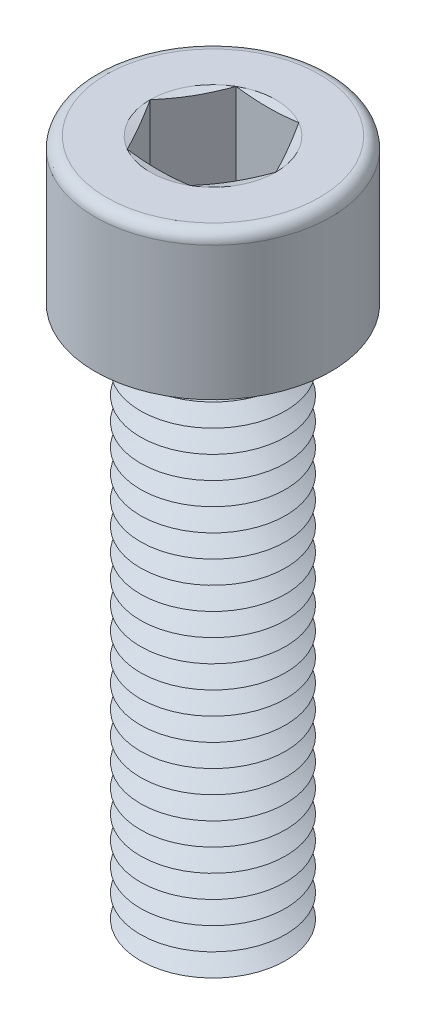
ISO-10303-21;
HEADER;
FILE_DESCRIPTION(('STEP AP214'),'2;1');
FILE_NAME('part.step','',(''),(''),'','','');
FILE_SCHEMA(('AUTOMOTIVE_DESIGN { 1 0 10303 214 1 1 1 1 }'));
ENDSEC;
DATA;
#1=APPLICATION_CONTEXT('core data for automotive mechanical design processes');
#2=APPLICATION_PROTOCOL_DEFINITION('international standard','automotive_design',2000,#1);
#3=PRODUCT_CONTEXT('',#1,'mechanical');
#4=PRODUCT('Part','Part','',(#3));
#5=PRODUCT_RELATED_PRODUCT_CATEGORY('part','',(#4));
#6=PRODUCT_DEFINITION_FORMATION('','',#4);
#7=PRODUCT_DEFINITION_CONTEXT('part definition',#1,'design');
#8=PRODUCT_DEFINITION('design','',#6,#7);
#9=PRODUCT_DEFINITION_SHAPE('','',#8);
#10=(LENGTH_UNIT() NAMED_UNIT(*) SI_UNIT(.MILLI.,.METRE.));
#11=(NAMED_UNIT(*) PLANE_ANGLE_UNIT() SI_UNIT($,.RADIAN.));
#12=(NAMED_UNIT(*) SI_UNIT($,.STERADIAN.) SOLID_ANGLE_UNIT());
#13=UNCERTAINTY_MEASURE_WITH_UNIT(LENGTH_MEASURE(1.E-05),#10,'distance_accuracy_value','');
#14=(GEOMETRIC_REPRESENTATION_CONTEXT(3) GLOBAL_UNCERTAINTY_ASSIGNED_CONTEXT((#13)) GLOBAL_UNIT_ASSIGNED_CONTEXT((#10,
#11,#12)) REPRESENTATION_CONTEXT('',''));
#15=CARTESIAN_POINT('',(0.,0.,0.));
#16=DIRECTION('',(0.,0.,1.));
#17=DIRECTION('',(1.,0.,0.));
#18=AXIS2_PLACEMENT_3D('',#15,#16,#17);
#19=CARTESIAN_POINT('',(0.,5.,0.));
#20=DIRECTION('',(0.,1.,0.));
#21=DIRECTION('',(0.,0.,1.));
#22=AXIS2_PLACEMENT_3D('',#19,#20,#21);
#23=CONICAL_SURFACE('',#22,2.91746824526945,1.0471975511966);
#24=CARTESIAN_POINT('',(0.,5.625,0.));
#25=DIRECTION('',(0.,1.,0.));
#26=DIRECTION('',(0.,0.,1.));
#27=AXIS2_PLACEMENT_3D('',#24,#25,#26);
#28=CIRCLE('',#27,4.);
#29=CARTESIAN_POINT('',(0.,5.625,4.));
#30=VERTEX_POINT('',#29);
#31=EDGE_CURVE('E504',#30,#30,#28,.T.);
#32=ORIENTED_EDGE('',*,*,#31,.F.);
#33=EDGE_LOOP('',(#32));
#34=FACE_BOUND('',#33,.T.);
#35=CARTESIAN_POINT('',(0.,5.,0.));
#36=DIRECTION('',(0.,1.,0.));
#37=DIRECTION('',(0.,0.,1.));
#38=AXIS2_PLACEMENT_3D('',#35,#36,#37);
#39=CIRCLE('',#38,2.91746824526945);
#40=CARTESIAN_POINT('',(0.,5.,2.91746824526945));
#41=VERTEX_POINT('',#40);
#42=EDGE_CURVE('E508',#41,#41,#39,.T.);
#43=ORIENTED_EDGE('',*,*,#42,.T.);
#44=EDGE_LOOP('',(#43));
#45=FACE_BOUND('',#44,.T.);
#46=ADVANCED_FACE('F41',(#34,#45),#23,.T.);
#47=CARTESIAN_POINT('',(0.,4.375,0.));
#48=DIRECTION('',(0.,-1.,0.));
#49=DIRECTION('',(0.,0.,-1.));
#50=AXIS2_PLACEMENT_3D('',#47,#48,#49);
#51=CONICAL_SURFACE('',#50,4.,1.0471975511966);
#52=ORIENTED_EDGE('',*,*,#42,.F.);
#53=EDGE_LOOP('',(#52));
#54=FACE_BOUND('',#53,.T.);
#55=CARTESIAN_POINT('',(0.,4.375,0.));
#56=DIRECTION('',(0.,1.,0.));
#57=DIRECTION('',(0.,0.,1.));
#58=AXIS2_PLACEMENT_3D('',#55,#56,#57);
#59=CIRCLE('',#58,4.);
#60=CARTESIAN_POINT('',(0.,4.375,4.));
#61=VERTEX_POINT('',#60);
#62=EDGE_CURVE('E512',#61,#61,#59,.T.);
#63=ORIENTED_EDGE('',*,*,#62,.T.);
#64=EDGE_LOOP('',(#63));
#65=FACE_BOUND('',#64,.T.);
#66=ADVANCED_FACE('F251',(#54,#65),#51,.T.);
#67=CARTESIAN_POINT('',(0.,0.,0.));
#68=DIRECTION('',(0.,1.,0.));
#69=DIRECTION('',(0.,0.,1.));
#70=AXIS2_PLACEMENT_3D('',#67,#68,#69);
#71=PLANE('',#70);
#72=CARTESIAN_POINT('',(0.,0.,0.));
#73=DIRECTION('',(0.,1.,0.));
#74=DIRECTION('',(0.,0.,1.));
#75=AXIS2_PLACEMENT_3D('',#72,#73,#74);
#76=CIRCLE('',#75,2.91746824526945);
#77=CARTESIAN_POINT('',(0.,0.,2.91746824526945));
#78=VERTEX_POINT('',#77);
#79=EDGE_CURVE('E540',#78,#78,#76,.T.);
#80=ORIENTED_EDGE('',*,*,#79,.F.);
#81=EDGE_LOOP('',(#80));
#82=FACE_BOUND('',#81,.T.);
#83=ADVANCED_FACE('F248',(#82),#71,.F.);
#84=CARTESIAN_POINT('',(0.,0.,0.));
#85=DIRECTION('',(0.,1.,0.));
#86=DIRECTION('',(0.,0.,1.));
#87=AXIS2_PLACEMENT_3D('',#84,#85,#86);
#88=CONICAL_SURFACE('',#87,2.91746824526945,1.0471975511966);
#89=CARTESIAN_POINT('',(0.,0.624999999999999,0.));
#90=DIRECTION('',(0.,1.,0.));
#91=DIRECTION('',(0.,0.,1.));
#92=AXIS2_PLACEMENT_3D('',#89,#90,#91);
#93=CIRCLE('',#92,4.);
#94=CARTESIAN_POINT('',(0.,0.624999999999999,4.));
#95=VERTEX_POINT('',#94);
#96=EDGE_CURVE('E536',#95,#95,#93,.T.);
#97=ORIENTED_EDGE('',*,*,#96,.F.);
#98=EDGE_LOOP('',(#97));
#99=FACE_BOUND('',#98,.T.);
#100=ORIENTED_EDGE('',*,*,#79,.T.);
#101=EDGE_LOOP('',(#100));
#102=FACE_BOUND('',#101,.T.);
#103=ADVANCED_FACE('F250',(#99,#102),#88,.T.);
#104=CARTESIAN_POINT('',(0.,0.624999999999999,0.));
#105=DIRECTION('',(0.,-1.,0.));
#106=DIRECTION('',(0.,0.,-1.));
#107=AXIS2_PLACEMENT_3D('',#104,#105,#106);
#108=CONICAL_SURFACE('',#107,4.,1.0471975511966);
#109=CARTESIAN_POINT('',(0.,1.25,0.));
#110=DIRECTION('',(0.,1.,0.));
#111=DIRECTION('',(0.,0.,1.));
#112=AXIS2_PLACEMENT_3D('',#109,#110,#111);
#113=CIRCLE('',#112,2.91746824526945);
#114=CARTESIAN_POINT('',(0.,1.25,2.91746824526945));
#115=VERTEX_POINT('',#114);
#116=EDGE_CURVE('E532',#115,#115,#113,.T.);
#117=ORIENTED_EDGE('',*,*,#116,.F.);
#118=EDGE_LOOP('',(#117));
#119=FACE_BOUND('',#118,.T.);
#120=ORIENTED_EDGE('',*,*,#96,.T.);
#121=EDGE_LOOP('',(#120));
#122=FACE_BOUND('',#121,.T.);
#123=ADVANCED_FACE('F291',(#119,#122),#108,.T.);
#124=CARTESIAN_POINT('',(0.,1.25,0.));
#125=DIRECTION('',(0.,1.,0.));
#126=DIRECTION('',(0.,0.,1.));
#127=AXIS2_PLACEMENT_3D('',#124,#125,#126);
#128=CONICAL_SURFACE('',#127,2.91746824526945,1.0471975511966);
#129=CARTESIAN_POINT('',(0.,1.875,0.));
#130=DIRECTION('',(0.,1.,0.));
#131=DIRECTION('',(0.,0.,1.));
#132=AXIS2_PLACEMENT_3D('',#129,#130,#131);
#133=CIRCLE('',#132,4.);
#134=CARTESIAN_POINT('',(0.,1.875,4.));
#135=VERTEX_POINT('',#134);
#136=EDGE_CURVE('E528',#135,#135,#133,.T.);
#137=ORIENTED_EDGE('',*,*,#136,.F.);
#138=EDGE_LOOP('',(#137));
#139=FACE_BOUND('',#138,.T.);
#140=ORIENTED_EDGE('',*,*,#116,.T.);
#141=EDGE_LOOP('',(#140));
#142=FACE_BOUND('',#141,.T.);
#143=ADVANCED_FACE('F286',(#139,#142),#128,.T.);
#144=CARTESIAN_POINT('',(0.,1.875,0.));
#145=DIRECTION('',(0.,-1.,0.));
#146=DIRECTION('',(0.,0.,-1.));
#147=AXIS2_PLACEMENT_3D('',#144,#145,#146);
#148=CONICAL_SURFACE('',#147,4.,1.0471975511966);
#149=CARTESIAN_POINT('',(0.,2.5,0.));
#150=DIRECTION('',(0.,1.,0.));
#151=DIRECTION('',(0.,0.,1.));
#152=AXIS2_PLACEMENT_3D('',#149,#150,#151);
#153=CIRCLE('',#152,2.91746824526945);
#154=CARTESIAN_POINT('',(0.,2.5,2.91746824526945));
#155=VERTEX_POINT('',#154);
#156=EDGE_CURVE('E524',#155,#155,#153,.T.);
#157=ORIENTED_EDGE('',*,*,#156,.F.);
#158=EDGE_LOOP('',(#157));
#159=FACE_BOUND('',#158,.T.);
#160=ORIENTED_EDGE('',*,*,#136,.T.);
#161=EDGE_LOOP('',(#160));
#162=FACE_BOUND('',#161,.T.);
#163=ADVANCED_FACE('F283',(#159,#162),#148,.T.);
#164=CARTESIAN_POINT('',(0.,2.5,0.));
#165=DIRECTION('',(0.,1.,0.));
#166=DIRECTION('',(0.,0.,1.));
#167=AXIS2_PLACEMENT_3D('',#164,#165,#166);
#168=CONICAL_SURFACE('',#167,2.91746824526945,1.0471975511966);
#169=CARTESIAN_POINT('',(0.,3.125,0.));
#170=DIRECTION('',(0.,1.,0.));
#171=DIRECTION('',(0.,0.,1.));
#172=AXIS2_PLACEMENT_3D('',#169,#170,#171);
#173=CIRCLE('',#172,4.);
#174=CARTESIAN_POINT('',(0.,3.125,4.));
#175=VERTEX_POINT('',#174);
#176=EDGE_CURVE('E520',#175,#175,#173,.T.);
#177=ORIENTED_EDGE('',*,*,#176,.F.);
#178=EDGE_LOOP('',(#177));
#179=FACE_BOUND('',#178,.T.);
#180=ORIENTED_EDGE('',*,*,#156,.T.);
#181=EDGE_LOOP('',(#180));
#182=FACE_BOUND('',#181,.T.);
#183=ADVANCED_FACE('F277',(#179,#182),#168,.T.);
#184=CARTESIAN_POINT('',(0.,3.125,0.));
#185=DIRECTION('',(0.,-1.,0.));
#186=DIRECTION('',(0.,0.,-1.));
#187=AXIS2_PLACEMENT_3D('',#184,#185,#186);
#188=CONICAL_SURFACE('',#187,4.,1.0471975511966);
#189=CARTESIAN_POINT('',(0.,3.75,0.));
#190=DIRECTION('',(0.,1.,0.));
#191=DIRECTION('',(0.,0.,1.));
#192=AXIS2_PLACEMENT_3D('',#189,#190,#191);
#193=CIRCLE('',#192,2.91746824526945);
#194=CARTESIAN_POINT('',(0.,3.75,2.91746824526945));
#195=VERTEX_POINT('',#194);
#196=EDGE_CURVE('E516',#195,#195,#193,.T.);
#197=ORIENTED_EDGE('',*,*,#196,.F.);
#198=EDGE_LOOP('',(#197));
#199=FACE_BOUND('',#198,.T.);
#200=ORIENTED_EDGE('',*,*,#176,.T.);
#201=EDGE_LOOP('',(#200));
#202=FACE_BOUND('',#201,.T.);
#203=ADVANCED_FACE('F273',(#199,#202),#188,.T.);
#204=CARTESIAN_POINT('',(0.,3.75,0.));
#205=DIRECTION('',(0.,1.,0.));
#206=DIRECTION('',(0.,0.,1.));
#207=AXIS2_PLACEMENT_3D('',#204,#205,#206);
#208=CONICAL_SURFACE('',#207,2.91746824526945,1.0471975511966);
#209=ORIENTED_EDGE('',*,*,#62,.F.);
#210=EDGE_LOOP('',(#209));
#211=FACE_BOUND('',#210,.T.);
#212=ORIENTED_EDGE('',*,*,#196,.T.);
#213=EDGE_LOOP('',(#212));
#214=FACE_BOUND('',#213,.T.);
#215=ADVANCED_FACE('F276',(#211,#214),#208,.T.);
#216=CARTESIAN_POINT('',(0.,6.25,0.));
#217=DIRECTION('',(0.,1.,0.));
#218=DIRECTION('',(0.,0.,1.));
#219=AXIS2_PLACEMENT_3D('',#216,#217,#218);
#220=CONICAL_SURFACE('',#219,2.91746824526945,1.0471975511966);
#221=CARTESIAN_POINT('',(0.,6.875,0.));
#222=DIRECTION('',(0.,1.,0.));
#223=DIRECTION('',(0.,0.,1.));
#224=AXIS2_PLACEMENT_3D('',#221,#222,#223);
#225=CIRCLE('',#224,4.);
#226=CARTESIAN_POINT('',(0.,6.875,4.));
#227=VERTEX_POINT('',#226);
#228=EDGE_CURVE('E496',#227,#227,#225,.T.);
#229=ORIENTED_EDGE('',*,*,#228,.F.);
#230=EDGE_LOOP('',(#229));
#231=FACE_BOUND('',#230,.T.);
#232=CARTESIAN_POINT('',(0.,6.25,0.));
#233=DIRECTION('',(0.,1.,0.));
#234=DIRECTION('',(0.,0.,1.));
#235=AXIS2_PLACEMENT_3D('',#232,#233,#234);
#236=CIRCLE('',#235,2.91746824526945);
#237=CARTESIAN_POINT('',(0.,6.25,2.91746824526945));
#238=VERTEX_POINT('',#237);
#239=EDGE_CURVE('E500',#238,#238,#236,.T.);
#240=ORIENTED_EDGE('',*,*,#239,.T.);
#241=EDGE_LOOP('',(#240));
#242=FACE_BOUND('',#241,.T.);
#243=ADVANCED_FACE('F281',(#231,#242),#220,.T.);
#244=CARTESIAN_POINT('',(0.,5.625,0.));
#245=DIRECTION('',(0.,-1.,0.));
#246=DIRECTION('',(0.,0.,-1.));
#247=AXIS2_PLACEMENT_3D('',#244,#245,#246);
#248=CONICAL_SURFACE('',#247,4.,1.0471975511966);
#249=ORIENTED_EDGE('',*,*,#239,.F.);
#250=EDGE_LOOP('',(#249));
#251=FACE_BOUND('',#250,.T.);
#252=ORIENTED_EDGE('',*,*,#31,.T.);
#253=EDGE_LOOP('',(#252));
#254=FACE_BOUND('',#253,.T.);
#255=ADVANCED_FACE('F769',(#251,#254),#248,.T.);
#256=CARTESIAN_POINT('',(0.,7.5,0.));
#257=DIRECTION('',(0.,1.,0.));
#258=DIRECTION('',(0.,0.,1.));
#259=AXIS2_PLACEMENT_3D('',#256,#257,#258);
#260=CONICAL_SURFACE('',#259,2.91746824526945,1.0471975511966);
#261=CARTESIAN_POINT('',(0.,8.125,0.));
#262=DIRECTION('',(0.,1.,0.));
#263=DIRECTION('',(0.,0.,1.));
#264=AXIS2_PLACEMENT_3D('',#261,#262,#263);
#265=CIRCLE('',#264,4.);
#266=CARTESIAN_POINT('',(0.,8.125,4.));
#267=VERTEX_POINT('',#266);
#268=EDGE_CURVE('E488',#267,#267,#265,.T.);
#269=ORIENTED_EDGE('',*,*,#268,.F.);
#270=EDGE_LOOP('',(#269));
#271=FACE_BOUND('',#270,.T.);
#272=CARTESIAN_POINT('',(0.,7.5,0.));
#273=DIRECTION('',(0.,1.,0.));
#274=DIRECTION('',(0.,0.,1.));
#275=AXIS2_PLACEMENT_3D('',#272,#273,#274);
#276=CIRCLE('',#275,2.91746824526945);
#277=CARTESIAN_POINT('',(0.,7.5,2.91746824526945));
#278=VERTEX_POINT('',#277);
#279=EDGE_CURVE('E492',#278,#278,#276,.T.);
#280=ORIENTED_EDGE('',*,*,#279,.T.);
#281=EDGE_LOOP('',(#280));
#282=FACE_BOUND('',#281,.T.);
#283=ADVANCED_FACE('F778',(#271,#282),#260,.T.);
#284=CARTESIAN_POINT('',(0.,6.875,0.));
#285=DIRECTION('',(0.,-1.,0.));
#286=DIRECTION('',(0.,0.,-1.));
#287=AXIS2_PLACEMENT_3D('',#284,#285,#286);
#288=CONICAL_SURFACE('',#287,4.,1.0471975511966);
#289=ORIENTED_EDGE('',*,*,#279,.F.);
#290=EDGE_LOOP('',(#289));
#291=FACE_BOUND('',#290,.T.);
#292=ORIENTED_EDGE('',*,*,#228,.T.);
#293=EDGE_LOOP('',(#292));
#294=FACE_BOUND('',#293,.T.);
#295=ADVANCED_FACE('F788',(#291,#294),#288,.T.);
#296=CARTESIAN_POINT('',(0.,8.75,0.));
#297=DIRECTION('',(0.,1.,0.));
#298=DIRECTION('',(0.,0.,1.));
#299=AXIS2_PLACEMENT_3D('',#296,#297,#298);
#300=CONICAL_SURFACE('',#299,2.91746824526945,1.0471975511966);
#301=CARTESIAN_POINT('',(0.,9.375,0.));
#302=DIRECTION('',(0.,1.,0.));
#303=DIRECTION('',(0.,0.,1.));
#304=AXIS2_PLACEMENT_3D('',#301,#302,#303);
#305=CIRCLE('',#304,4.);
#306=CARTESIAN_POINT('',(0.,9.375,4.));
#307=VERTEX_POINT('',#306);
#308=EDGE_CURVE('E481',#307,#307,#305,.T.);
#309=ORIENTED_EDGE('',*,*,#308,.F.);
#310=EDGE_LOOP('',(#309));
#311=FACE_BOUND('',#310,.T.);
#312=CARTESIAN_POINT('',(0.,8.75,0.));
#313=DIRECTION('',(0.,1.,0.));
#314=DIRECTION('',(0.,0.,1.));
#315=AXIS2_PLACEMENT_3D('',#312,#313,#314);
#316=CIRCLE('',#315,2.91746824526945);
#317=CARTESIAN_POINT('',(0.,8.75,2.91746824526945));
#318=VERTEX_POINT('',#317);
#319=EDGE_CURVE('E485',#318,#318,#316,.T.);
#320=ORIENTED_EDGE('',*,*,#319,.T.);
#321=EDGE_LOOP('',(#320));
#322=FACE_BOUND('',#321,.T.);
#323=ADVANCED_FACE('F798',(#311,#322),#300,.T.);
#324=CARTESIAN_POINT('',(0.,8.125,0.));
#325=DIRECTION('',(0.,-1.,0.));
#326=DIRECTION('',(0.,0.,-1.));
#327=AXIS2_PLACEMENT_3D('',#324,#325,#326);
#328=CONICAL_SURFACE('',#327,4.,1.0471975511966);
#329=ORIENTED_EDGE('',*,*,#319,.F.);
#330=EDGE_LOOP('',(#329));
#331=FACE_BOUND('',#330,.T.);
#332=ORIENTED_EDGE('',*,*,#268,.T.);
#333=EDGE_LOOP('',(#332));
#334=FACE_BOUND('',#333,.T.);
#335=ADVANCED_FACE('F808',(#331,#334),#328,.T.);
#336=CARTESIAN_POINT('',(0.,10.,0.));
#337=DIRECTION('',(0.,1.,0.));
#338=DIRECTION('',(0.,0.,1.));
#339=AXIS2_PLACEMENT_3D('',#336,#337,#338);
#340=CONICAL_SURFACE('',#339,2.91746824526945,1.0471975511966);
#341=CARTESIAN_POINT('',(0.,10.625,0.));
#342=DIRECTION('',(0.,1.,0.));
#343=DIRECTION('',(0.,0.,1.));
#344=AXIS2_PLACEMENT_3D('',#341,#342,#343);
#345=CIRCLE('',#344,4.);
#346=CARTESIAN_POINT('',(0.,10.625,4.));
#347=VERTEX_POINT('',#346);
#348=EDGE_CURVE('E473',#347,#347,#345,.T.);
#349=ORIENTED_EDGE('',*,*,#348,.F.);
#350=EDGE_LOOP('',(#349));
#351=FACE_BOUND('',#350,.T.);
#352=CARTESIAN_POINT('',(0.,10.,0.));
#353=DIRECTION('',(0.,1.,0.));
#354=DIRECTION('',(0.,0.,1.));
#355=AXIS2_PLACEMENT_3D('',#352,#353,#354);
#356=CIRCLE('',#355,2.91746824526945);
#357=CARTESIAN_POINT('',(0.,10.,2.91746824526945));
#358=VERTEX_POINT('',#357);
#359=EDGE_CURVE('E477',#358,#358,#356,.T.);
#360=ORIENTED_EDGE('',*,*,#359,.T.);
#361=EDGE_LOOP('',(#360));
#362=FACE_BOUND('',#361,.T.);
#363=ADVANCED_FACE('F818',(#351,#362),#340,.T.);
#364=CARTESIAN_POINT('',(0.,9.375,0.));
#365=DIRECTION('',(0.,-1.,0.));
#366=DIRECTION('',(0.,0.,-1.));
#367=AXIS2_PLACEMENT_3D('',#364,#365,#366);
#368=CONICAL_SURFACE('',#367,4.,1.0471975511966);
#369=ORIENTED_EDGE('',*,*,#359,.F.);
#370=EDGE_LOOP('',(#369));
#371=FACE_BOUND('',#370,.T.);
#372=ORIENTED_EDGE('',*,*,#308,.T.);
#373=EDGE_LOOP('',(#372));
#374=FACE_BOUND('',#373,.T.);
#375=ADVANCED_FACE('F828',(#371,#374),#368,.T.);
#376=CARTESIAN_POINT('',(0.,11.25,0.));
#377=DIRECTION('',(0.,1.,0.));
#378=DIRECTION('',(0.,0.,1.));
#379=AXIS2_PLACEMENT_3D('',#376,#377,#378);
#380=CONICAL_SURFACE('',#379,2.91746824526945,1.0471975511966);
#381=CARTESIAN_POINT('',(0.,11.875,0.));
#382=DIRECTION('',(0.,1.,0.));
#383=DIRECTION('',(0.,0.,1.));
#384=AXIS2_PLACEMENT_3D('',#381,#382,#383);
#385=CIRCLE('',#384,4.);
#386=CARTESIAN_POINT('',(0.,11.875,4.));
#387=VERTEX_POINT('',#386);
#388=EDGE_CURVE('E465',#387,#387,#385,.T.);
#389=ORIENTED_EDGE('',*,*,#388,.F.);
#390=EDGE_LOOP('',(#389));
#391=FACE_BOUND('',#390,.T.);
#392=CARTESIAN_POINT('',(0.,11.25,0.));
#393=DIRECTION('',(0.,1.,0.));
#394=DIRECTION('',(0.,0.,1.));
#395=AXIS2_PLACEMENT_3D('',#392,#393,#394);
#396=CIRCLE('',#395,2.91746824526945);
#397=CARTESIAN_POINT('',(0.,11.25,2.91746824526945));
#398=VERTEX_POINT('',#397);
#399=EDGE_CURVE('E469',#398,#398,#396,.T.);
#400=ORIENTED_EDGE('',*,*,#399,.T.);
#401=EDGE_LOOP('',(#400));
#402=FACE_BOUND('',#401,.T.);
#403=ADVANCED_FACE('F838',(#391,#402),#380,.T.);
#404=CARTESIAN_POINT('',(0.,10.625,0.));
#405=DIRECTION('',(0.,-1.,0.));
#406=DIRECTION('',(0.,0.,-1.));
#407=AXIS2_PLACEMENT_3D('',#404,#405,#406);
#408=CONICAL_SURFACE('',#407,4.,1.0471975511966);
#409=ORIENTED_EDGE('',*,*,#399,.F.);
#410=EDGE_LOOP('',(#409));
#411=FACE_BOUND('',#410,.T.);
#412=ORIENTED_EDGE('',*,*,#348,.T.);
#413=EDGE_LOOP('',(#412));
#414=FACE_BOUND('',#413,.T.);
#415=ADVANCED_FACE('F848',(#411,#414),#408,.T.);
#416=CARTESIAN_POINT('',(0.,12.5,0.));
#417=DIRECTION('',(0.,1.,0.));
#418=DIRECTION('',(0.,0.,1.));
#419=AXIS2_PLACEMENT_3D('',#416,#417,#418);
#420=CONICAL_SURFACE('',#419,2.91746824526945,1.0471975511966);
#421=CARTESIAN_POINT('',(0.,13.125,0.));
#422=DIRECTION('',(0.,1.,0.));
#423=DIRECTION('',(0.,0.,1.));
#424=AXIS2_PLACEMENT_3D('',#421,#422,#423);
#425=CIRCLE('',#424,4.);
#426=CARTESIAN_POINT('',(0.,13.125,4.));
#427=VERTEX_POINT('',#426);
#428=EDGE_CURVE('E457',#427,#427,#425,.T.);
#429=ORIENTED_EDGE('',*,*,#428,.F.);
#430=EDGE_LOOP('',(#429));
#431=FACE_BOUND('',#430,.T.);
#432=CARTESIAN_POINT('',(0.,12.5,0.));
#433=DIRECTION('',(0.,1.,0.));
#434=DIRECTION('',(0.,0.,1.));
#435=AXIS2_PLACEMENT_3D('',#432,#433,#434);
#436=CIRCLE('',#435,2.91746824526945);
#437=CARTESIAN_POINT('',(0.,12.5,2.91746824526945));
#438=VERTEX_POINT('',#437);
#439=EDGE_CURVE('E461',#438,#438,#436,.T.);
#440=ORIENTED_EDGE('',*,*,#439,.T.);
#441=EDGE_LOOP('',(#440));
#442=FACE_BOUND('',#441,.T.);
#443=ADVANCED_FACE('F858',(#431,#442),#420,.T.);
#444=CARTESIAN_POINT('',(0.,11.875,0.));
#445=DIRECTION('',(0.,-1.,0.));
#446=DIRECTION('',(0.,0.,-1.));
#447=AXIS2_PLACEMENT_3D('',#444,#445,#446);
#448=CONICAL_SURFACE('',#447,4.,1.0471975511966);
#449=ORIENTED_EDGE('',*,*,#439,.F.);
#450=EDGE_LOOP('',(#449));
#451=FACE_BOUND('',#450,.T.);
#452=ORIENTED_EDGE('',*,*,#388,.T.);
#453=EDGE_LOOP('',(#452));
#454=FACE_BOUND('',#453,.T.);
#455=ADVANCED_FACE('F868',(#451,#454),#448,.T.);
#456=CARTESIAN_POINT('',(0.,13.75,0.));
#457=DIRECTION('',(0.,1.,0.));
#458=DIRECTION('',(0.,0.,1.));
#459=AXIS2_PLACEMENT_3D('',#456,#457,#458);
#460=CONICAL_SURFACE('',#459,2.91746824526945,1.0471975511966);
#461=CARTESIAN_POINT('',(0.,14.375,0.));
#462=DIRECTION('',(0.,1.,0.));
#463=DIRECTION('',(0.,0.,1.));
#464=AXIS2_PLACEMENT_3D('',#461,#462,#463);
#465=CIRCLE('',#464,4.);
#466=CARTESIAN_POINT('',(0.,14.375,4.));
#467=VERTEX_POINT('',#466);
#468=EDGE_CURVE('E449',#467,#467,#465,.T.);
#469=ORIENTED_EDGE('',*,*,#468,.F.);
#470=EDGE_LOOP('',(#469));
#471=FACE_BOUND('',#470,.T.);
#472=CARTESIAN_POINT('',(0.,13.75,0.));
#473=DIRECTION('',(0.,1.,0.));
#474=DIRECTION('',(0.,0.,1.));
#475=AXIS2_PLACEMENT_3D('',#472,#473,#474);
#476=CIRCLE('',#475,2.91746824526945);
#477=CARTESIAN_POINT('',(0.,13.75,2.91746824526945));
#478=VERTEX_POINT('',#477);
#479=EDGE_CURVE('E453',#478,#478,#476,.T.);
#480=ORIENTED_EDGE('',*,*,#479,.T.);
#481=EDGE_LOOP('',(#480));
#482=FACE_BOUND('',#481,.T.);
#483=ADVANCED_FACE('F878',(#471,#482),#460,.T.);
#484=CARTESIAN_POINT('',(0.,13.125,0.));
#485=DIRECTION('',(0.,-1.,0.));
#486=DIRECTION('',(0.,0.,-1.));
#487=AXIS2_PLACEMENT_3D('',#484,#485,#486);
#488=CONICAL_SURFACE('',#487,4.,1.0471975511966);
#489=ORIENTED_EDGE('',*,*,#479,.F.);
#490=EDGE_LOOP('',(#489));
#491=FACE_BOUND('',#490,.T.);
#492=ORIENTED_EDGE('',*,*,#428,.T.);
#493=EDGE_LOOP('',(#492));
#494=FACE_BOUND('',#493,.T.);
#495=ADVANCED_FACE('F888',(#491,#494),#488,.T.);
#496=CARTESIAN_POINT('',(0.,15.,0.));
#497=DIRECTION('',(0.,1.,0.));
#498=DIRECTION('',(0.,0.,1.));
#499=AXIS2_PLACEMENT_3D('',#496,#497,#498);
#500=CONICAL_SURFACE('',#499,2.91746824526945,1.0471975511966);
#501=CARTESIAN_POINT('',(0.,15.625,0.));
#502=DIRECTION('',(0.,1.,0.));
#503=DIRECTION('',(0.,0.,1.));
#504=AXIS2_PLACEMENT_3D('',#501,#502,#503);
#505=CIRCLE('',#504,4.);
#506=CARTESIAN_POINT('',(0.,15.625,4.));
#507=VERTEX_POINT('',#506);
#508=EDGE_CURVE('E441',#507,#507,#505,.T.);
#509=ORIENTED_EDGE('',*,*,#508,.F.);
#510=EDGE_LOOP('',(#509));
#511=FACE_BOUND('',#510,.T.);
#512=CARTESIAN_POINT('',(0.,15.,0.));
#513=DIRECTION('',(0.,1.,0.));
#514=DIRECTION('',(0.,0.,1.));
#515=AXIS2_PLACEMENT_3D('',#512,#513,#514);
#516=CIRCLE('',#515,2.91746824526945);
#517=CARTESIAN_POINT('',(0.,15.,2.91746824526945));
#518=VERTEX_POINT('',#517);
#519=EDGE_CURVE('E445',#518,#518,#516,.T.);
#520=ORIENTED_EDGE('',*,*,#519,.T.);
#521=EDGE_LOOP('',(#520));
#522=FACE_BOUND('',#521,.T.);
#523=ADVANCED_FACE('F898',(#511,#522),#500,.T.);
#524=CARTESIAN_POINT('',(0.,14.375,0.));
#525=DIRECTION('',(0.,-1.,0.));
#526=DIRECTION('',(0.,0.,-1.));
#527=AXIS2_PLACEMENT_3D('',#524,#525,#526);
#528=CONICAL_SURFACE('',#527,4.,1.0471975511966);
#529=ORIENTED_EDGE('',*,*,#519,.F.);
#530=EDGE_LOOP('',(#529));
#531=FACE_BOUND('',#530,.T.);
#532=ORIENTED_EDGE('',*,*,#468,.T.);
#533=EDGE_LOOP('',(#532));
#534=FACE_BOUND('',#533,.T.);
#535=ADVANCED_FACE('F908',(#531,#534),#528,.T.);
#536=CARTESIAN_POINT('',(0.,16.25,0.));
#537=DIRECTION('',(0.,1.,0.));
#538=DIRECTION('',(0.,0.,1.));
#539=AXIS2_PLACEMENT_3D('',#536,#537,#538);
#540=CONICAL_SURFACE('',#539,2.91746824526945,1.0471975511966);
#541=CARTESIAN_POINT('',(0.,16.875,0.));
#542=DIRECTION('',(0.,1.,0.));
#543=DIRECTION('',(0.,0.,1.));
#544=AXIS2_PLACEMENT_3D('',#541,#542,#543);
#545=CIRCLE('',#544,4.);
#546=CARTESIAN_POINT('',(0.,16.875,4.));
#547=VERTEX_POINT('',#546);
#548=EDGE_CURVE('E433',#547,#547,#545,.T.);
#549=ORIENTED_EDGE('',*,*,#548,.F.);
#550=EDGE_LOOP('',(#549));
#551=FACE_BOUND('',#550,.T.);
#552=CARTESIAN_POINT('',(0.,16.25,0.));
#553=DIRECTION('',(0.,1.,0.));
#554=DIRECTION('',(0.,0.,1.));
#555=AXIS2_PLACEMENT_3D('',#552,#553,#554);
#556=CIRCLE('',#555,2.91746824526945);
#557=CARTESIAN_POINT('',(0.,16.25,2.91746824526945));
#558=VERTEX_POINT('',#557);
#559=EDGE_CURVE('E437',#558,#558,#556,.T.);
#560=ORIENTED_EDGE('',*,*,#559,.T.);
#561=EDGE_LOOP('',(#560));
#562=FACE_BOUND('',#561,.T.);
#563=ADVANCED_FACE('F918',(#551,#562),#540,.T.);
#564=CARTESIAN_POINT('',(0.,15.625,0.));
#565=DIRECTION('',(0.,-1.,0.));
#566=DIRECTION('',(0.,0.,-1.));
#567=AXIS2_PLACEMENT_3D('',#564,#565,#566);
#568=CONICAL_SURFACE('',#567,4.,1.0471975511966);
#569=ORIENTED_EDGE('',*,*,#559,.F.);
#570=EDGE_LOOP('',(#569));
#571=FACE_BOUND('',#570,.T.);
#572=ORIENTED_EDGE('',*,*,#508,.T.);
#573=EDGE_LOOP('',(#572));
#574=FACE_BOUND('',#573,.T.);
#575=ADVANCED_FACE('F928',(#571,#574),#568,.T.);
#576=CARTESIAN_POINT('',(0.,17.5,0.));
#577=DIRECTION('',(0.,1.,0.));
#578=DIRECTION('',(0.,0.,1.));
#579=AXIS2_PLACEMENT_3D('',#576,#577,#578);
#580=CONICAL_SURFACE('',#579,2.91746824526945,1.0471975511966);
#581=CARTESIAN_POINT('',(0.,18.125,0.));
#582=DIRECTION('',(0.,1.,0.));
#583=DIRECTION('',(0.,0.,1.));
#584=AXIS2_PLACEMENT_3D('',#581,#582,#583);
#585=CIRCLE('',#584,4.);
#586=CARTESIAN_POINT('',(0.,18.125,4.));
#587=VERTEX_POINT('',#586);
#588=EDGE_CURVE('E425',#587,#587,#585,.T.);
#589=ORIENTED_EDGE('',*,*,#588,.F.);
#590=EDGE_LOOP('',(#589));
#591=FACE_BOUND('',#590,.T.);
#592=CARTESIAN_POINT('',(0.,17.5,0.));
#593=DIRECTION('',(0.,1.,0.));
#594=DIRECTION('',(0.,0.,1.));
#595=AXIS2_PLACEMENT_3D('',#592,#593,#594);
#596=CIRCLE('',#595,2.91746824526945);
#597=CARTESIAN_POINT('',(0.,17.5,2.91746824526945));
#598=VERTEX_POINT('',#597);
#599=EDGE_CURVE('E429',#598,#598,#596,.T.);
#600=ORIENTED_EDGE('',*,*,#599,.T.);
#601=EDGE_LOOP('',(#600));
#602=FACE_BOUND('',#601,.T.);
#603=ADVANCED_FACE('F938',(#591,#602),#580,.T.);
#604=CARTESIAN_POINT('',(0.,16.875,0.));
#605=DIRECTION('',(0.,-1.,0.));
#606=DIRECTION('',(0.,0.,-1.));
#607=AXIS2_PLACEMENT_3D('',#604,#605,#606);
#608=CONICAL_SURFACE('',#607,4.,1.0471975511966);
#609=ORIENTED_EDGE('',*,*,#599,.F.);
#610=EDGE_LOOP('',(#609));
#611=FACE_BOUND('',#610,.T.);
#612=ORIENTED_EDGE('',*,*,#548,.T.);
#613=EDGE_LOOP('',(#612));
#614=FACE_BOUND('',#613,.T.);
#615=ADVANCED_FACE('F948',(#611,#614),#608,.T.);
#616=CARTESIAN_POINT('',(0.,18.75,0.));
#617=DIRECTION('',(0.,1.,0.));
#618=DIRECTION('',(0.,0.,1.));
#619=AXIS2_PLACEMENT_3D('',#616,#617,#618);
#620=CONICAL_SURFACE('',#619,2.91746824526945,1.0471975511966);
#621=CARTESIAN_POINT('',(0.,19.375,0.));
#622=DIRECTION('',(0.,1.,0.));
#623=DIRECTION('',(0.,0.,1.));
#624=AXIS2_PLACEMENT_3D('',#621,#622,#623);
#625=CIRCLE('',#624,4.);
#626=CARTESIAN_POINT('',(0.,19.375,4.));
#627=VERTEX_POINT('',#626);
#628=EDGE_CURVE('E417',#627,#627,#625,.T.);
#629=ORIENTED_EDGE('',*,*,#628,.F.);
#630=EDGE_LOOP('',(#629));
#631=FACE_BOUND('',#630,.T.);
#632=CARTESIAN_POINT('',(0.,18.75,0.));
#633=DIRECTION('',(0.,1.,0.));
#634=DIRECTION('',(0.,0.,1.));
#635=AXIS2_PLACEMENT_3D('',#632,#633,#634);
#636=CIRCLE('',#635,2.91746824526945);
#637=CARTESIAN_POINT('',(0.,18.75,2.91746824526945));
#638=VERTEX_POINT('',#637);
#639=EDGE_CURVE('E421',#638,#638,#636,.T.);
#640=ORIENTED_EDGE('',*,*,#639,.T.);
#641=EDGE_LOOP('',(#640));
#642=FACE_BOUND('',#641,.T.);
#643=ADVANCED_FACE('F958',(#631,#642),#620,.T.);
#644=CARTESIAN_POINT('',(0.,18.125,0.));
#645=DIRECTION('',(0.,-1.,0.));
#646=DIRECTION('',(0.,0.,-1.));
#647=AXIS2_PLACEMENT_3D('',#644,#645,#646);
#648=CONICAL_SURFACE('',#647,4.,1.0471975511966);
#649=ORIENTED_EDGE('',*,*,#639,.F.);
#650=EDGE_LOOP('',(#649));
#651=FACE_BOUND('',#650,.T.);
#652=ORIENTED_EDGE('',*,*,#588,.T.);
#653=EDGE_LOOP('',(#652));
#654=FACE_BOUND('',#653,.T.);
#655=ADVANCED_FACE('F968',(#651,#654),#648,.T.);
#656=CARTESIAN_POINT('',(0.,20.,0.));
#657=DIRECTION('',(0.,1.,0.));
#658=DIRECTION('',(0.,0.,1.));
#659=AXIS2_PLACEMENT_3D('',#656,#657,#658);
#660=CONICAL_SURFACE('',#659,2.91746824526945,1.0471975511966);
#661=CARTESIAN_POINT('',(0.,20.625,0.));
#662=DIRECTION('',(0.,1.,0.));
#663=DIRECTION('',(0.,0.,1.));
#664=AXIS2_PLACEMENT_3D('',#661,#662,#663);
#665=CIRCLE('',#664,4.);
#666=CARTESIAN_POINT('',(0.,20.625,4.));
#667=VERTEX_POINT('',#666);
#668=EDGE_CURVE('E409',#667,#667,#665,.T.);
#669=ORIENTED_EDGE('',*,*,#668,.F.);
#670=EDGE_LOOP('',(#669));
#671=FACE_BOUND('',#670,.T.);
#672=CARTESIAN_POINT('',(0.,20.,0.));
#673=DIRECTION('',(0.,1.,0.));
#674=DIRECTION('',(0.,0.,1.));
#675=AXIS2_PLACEMENT_3D('',#672,#673,#674);
#676=CIRCLE('',#675,2.91746824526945);
#677=CARTESIAN_POINT('',(0.,20.,2.91746824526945));
#678=VERTEX_POINT('',#677);
#679=EDGE_CURVE('E413',#678,#678,#676,.T.);
#680=ORIENTED_EDGE('',*,*,#679,.T.);
#681=EDGE_LOOP('',(#680));
#682=FACE_BOUND('',#681,.T.);
#683=ADVANCED_FACE('F978',(#671,#682),#660,.T.);
#684=CARTESIAN_POINT('',(0.,19.375,0.));
#685=DIRECTION('',(0.,-1.,0.));
#686=DIRECTION('',(0.,0.,-1.));
#687=AXIS2_PLACEMENT_3D('',#684,#685,#686);
#688=CONICAL_SURFACE('',#687,4.,1.0471975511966);
#689=ORIENTED_EDGE('',*,*,#679,.F.);
#690=EDGE_LOOP('',(#689));
#691=FACE_BOUND('',#690,.T.);
#692=ORIENTED_EDGE('',*,*,#628,.T.);
#693=EDGE_LOOP('',(#692));
#694=FACE_BOUND('',#693,.T.);
#695=ADVANCED_FACE('F988',(#691,#694),#688,.T.);
#696=CARTESIAN_POINT('',(0.,21.25,0.));
#697=DIRECTION('',(0.,1.,0.));
#698=DIRECTION('',(0.,0.,1.));
#699=AXIS2_PLACEMENT_3D('',#696,#697,#698);
#700=CONICAL_SURFACE('',#699,2.91746824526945,1.0471975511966);
#701=CARTESIAN_POINT('',(0.,21.875,0.));
#702=DIRECTION('',(0.,1.,0.));
#703=DIRECTION('',(0.,0.,1.));
#704=AXIS2_PLACEMENT_3D('',#701,#702,#703);
#705=CIRCLE('',#704,4.);
#706=CARTESIAN_POINT('',(0.,21.875,4.));
#707=VERTEX_POINT('',#706);
#708=EDGE_CURVE('E401',#707,#707,#705,.T.);
#709=ORIENTED_EDGE('',*,*,#708,.F.);
#710=EDGE_LOOP('',(#709));
#711=FACE_BOUND('',#710,.T.);
#712=CARTESIAN_POINT('',(0.,21.25,0.));
#713=DIRECTION('',(0.,1.,0.));
#714=DIRECTION('',(0.,0.,1.));
#715=AXIS2_PLACEMENT_3D('',#712,#713,#714);
#716=CIRCLE('',#715,2.91746824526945);
#717=CARTESIAN_POINT('',(0.,21.25,2.91746824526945));
#718=VERTEX_POINT('',#717);
#719=EDGE_CURVE('E405',#718,#718,#716,.T.);
#720=ORIENTED_EDGE('',*,*,#719,.T.);
#721=EDGE_LOOP('',(#720));
#722=FACE_BOUND('',#721,.T.);
#723=ADVANCED_FACE('F998',(#711,#722),#700,.T.);
#724=CARTESIAN_POINT('',(0.,20.625,0.));
#725=DIRECTION('',(0.,-1.,0.));
#726=DIRECTION('',(0.,0.,-1.));
#727=AXIS2_PLACEMENT_3D('',#724,#725,#726);
#728=CONICAL_SURFACE('',#727,4.,1.0471975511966);
#729=ORIENTED_EDGE('',*,*,#719,.F.);
#730=EDGE_LOOP('',(#729));
#731=FACE_BOUND('',#730,.T.);
#732=ORIENTED_EDGE('',*,*,#668,.T.);
#733=EDGE_LOOP('',(#732));
#734=FACE_BOUND('',#733,.T.);
#735=ADVANCED_FACE('F1008',(#731,#734),#728,.T.);
#736=CARTESIAN_POINT('',(0.,22.5,0.));
#737=DIRECTION('',(0.,1.,0.));
#738=DIRECTION('',(0.,0.,1.));
#739=AXIS2_PLACEMENT_3D('',#736,#737,#738);
#740=CONICAL_SURFACE('',#739,2.91746824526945,1.0471975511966);
#741=CARTESIAN_POINT('',(0.,23.125,0.));
#742=DIRECTION('',(0.,1.,0.));
#743=DIRECTION('',(0.,0.,1.));
#744=AXIS2_PLACEMENT_3D('',#741,#742,#743);
#745=CIRCLE('',#744,4.);
#746=CARTESIAN_POINT('',(0.,23.125,4.));
#747=VERTEX_POINT('',#746);
#748=EDGE_CURVE('E393',#747,#747,#745,.T.);
#749=ORIENTED_EDGE('',*,*,#748,.F.);
#750=EDGE_LOOP('',(#749));
#751=FACE_BOUND('',#750,.T.);
#752=CARTESIAN_POINT('',(0.,22.5,0.));
#753=DIRECTION('',(0.,1.,0.));
#754=DIRECTION('',(0.,0.,1.));
#755=AXIS2_PLACEMENT_3D('',#752,#753,#754);
#756=CIRCLE('',#755,2.91746824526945);
#757=CARTESIAN_POINT('',(0.,22.5,2.91746824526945));
#758=VERTEX_POINT('',#757);
#759=EDGE_CURVE('E397',#758,#758,#756,.T.);
#760=ORIENTED_EDGE('',*,*,#759,.T.);
#761=EDGE_LOOP('',(#760));
#762=FACE_BOUND('',#761,.T.);
#763=ADVANCED_FACE('F1018',(#751,#762),#740,.T.);
#764=CARTESIAN_POINT('',(0.,21.875,0.));
#765=DIRECTION('',(0.,-1.,0.));
#766=DIRECTION('',(0.,0.,-1.));
#767=AXIS2_PLACEMENT_3D('',#764,#765,#766);
#768=CONICAL_SURFACE('',#767,4.,1.0471975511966);
#769=ORIENTED_EDGE('',*,*,#759,.F.);
#770=EDGE_LOOP('',(#769));
#771=FACE_BOUND('',#770,.T.);
#772=ORIENTED_EDGE('',*,*,#708,.T.);
#773=EDGE_LOOP('',(#772));
#774=FACE_BOUND('',#773,.T.);
#775=ADVANCED_FACE('F1028',(#771,#774),#768,.T.);
#776=CARTESIAN_POINT('',(0.,23.75,0.));
#777=DIRECTION('',(0.,1.,0.));
#778=DIRECTION('',(0.,0.,1.));
#779=AXIS2_PLACEMENT_3D('',#776,#777,#778);
#780=CONICAL_SURFACE('',#779,2.91746824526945,1.0471975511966);
#781=CARTESIAN_POINT('',(0.,24.375,0.));
#782=DIRECTION('',(0.,1.,0.));
#783=DIRECTION('',(0.,0.,1.));
#784=AXIS2_PLACEMENT_3D('',#781,#782,#783);
#785=CIRCLE('',#784,4.);
#786=CARTESIAN_POINT('',(0.,24.375,4.));
#787=VERTEX_POINT('',#786);
#788=EDGE_CURVE('E385',#787,#787,#785,.T.);
#789=ORIENTED_EDGE('',*,*,#788,.F.);
#790=EDGE_LOOP('',(#789));
#791=FACE_BOUND('',#790,.T.);
#792=CARTESIAN_POINT('',(0.,23.75,0.));
#793=DIRECTION('',(0.,1.,0.));
#794=DIRECTION('',(0.,0.,1.));
#795=AXIS2_PLACEMENT_3D('',#792,#793,#794);
#796=CIRCLE('',#795,2.91746824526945);
#797=CARTESIAN_POINT('',(0.,23.75,2.91746824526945));
#798=VERTEX_POINT('',#797);
#799=EDGE_CURVE('E389',#798,#798,#796,.T.);
#800=ORIENTED_EDGE('',*,*,#799,.T.);
#801=EDGE_LOOP('',(#800));
#802=FACE_BOUND('',#801,.T.);
#803=ADVANCED_FACE('F1038',(#791,#802),#780,.T.);
#804=CARTESIAN_POINT('',(0.,23.125,0.));
#805=DIRECTION('',(0.,-1.,0.));
#806=DIRECTION('',(0.,0.,-1.));
#807=AXIS2_PLACEMENT_3D('',#804,#805,#806);
#808=CONICAL_SURFACE('',#807,4.,1.0471975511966);
#809=ORIENTED_EDGE('',*,*,#799,.F.);
#810=EDGE_LOOP('',(#809));
#811=FACE_BOUND('',#810,.T.);
#812=ORIENTED_EDGE('',*,*,#748,.T.);
#813=EDGE_LOOP('',(#812));
#814=FACE_BOUND('',#813,.T.);
#815=ADVANCED_FACE('F1048',(#811,#814),#808,.T.);
#816=CARTESIAN_POINT('',(0.,25.,0.));
#817=DIRECTION('',(0.,1.,0.));
#818=DIRECTION('',(0.,0.,1.));
#819=AXIS2_PLACEMENT_3D('',#816,#817,#818);
#820=CONICAL_SURFACE('',#819,2.91746824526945,1.0471975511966);
#821=CARTESIAN_POINT('',(0.,25.625,0.));
#822=DIRECTION('',(0.,1.,0.));
#823=DIRECTION('',(0.,0.,1.));
#824=AXIS2_PLACEMENT_3D('',#821,#822,#823);
#825=CIRCLE('',#824,4.);
#826=CARTESIAN_POINT('',(0.,25.625,4.));
#827=VERTEX_POINT('',#826);
#828=EDGE_CURVE('E377',#827,#827,#825,.T.);
#829=ORIENTED_EDGE('',*,*,#828,.F.);
#830=EDGE_LOOP('',(#829));
#831=FACE_BOUND('',#830,.T.);
#832=CARTESIAN_POINT('',(0.,25.,0.));
#833=DIRECTION('',(0.,1.,0.));
#834=DIRECTION('',(0.,0.,1.));
#835=AXIS2_PLACEMENT_3D('',#832,#833,#834);
#836=CIRCLE('',#835,2.91746824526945);
#837=CARTESIAN_POINT('',(0.,25.,2.91746824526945));
#838=VERTEX_POINT('',#837);
#839=EDGE_CURVE('E381',#838,#838,#836,.T.);
#840=ORIENTED_EDGE('',*,*,#839,.T.);
#841=EDGE_LOOP('',(#840));
#842=FACE_BOUND('',#841,.T.);
#843=ADVANCED_FACE('F1058',(#831,#842),#820,.T.);
#844=CARTESIAN_POINT('',(0.,24.375,0.));
#845=DIRECTION('',(0.,-1.,0.));
#846=DIRECTION('',(0.,0.,-1.));
#847=AXIS2_PLACEMENT_3D('',#844,#845,#846);
#848=CONICAL_SURFACE('',#847,4.,1.0471975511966);
#849=ORIENTED_EDGE('',*,*,#839,.F.);
#850=EDGE_LOOP('',(#849));
#851=FACE_BOUND('',#850,.T.);
#852=ORIENTED_EDGE('',*,*,#788,.T.);
#853=EDGE_LOOP('',(#852));
#854=FACE_BOUND('',#853,.T.);
#855=ADVANCED_FACE('F1068',(#851,#854),#848,.T.);
#856=CARTESIAN_POINT('',(0.,26.25,0.));
#857=DIRECTION('',(0.,1.,0.));
#858=DIRECTION('',(0.,0.,1.));
#859=AXIS2_PLACEMENT_3D('',#856,#857,#858);
#860=CONICAL_SURFACE('',#859,2.91746824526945,1.0471975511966);
#861=CARTESIAN_POINT('',(0.,26.875,0.));
#862=DIRECTION('',(0.,1.,0.));
#863=DIRECTION('',(0.,0.,1.));
#864=AXIS2_PLACEMENT_3D('',#861,#862,#863);
#865=CIRCLE('',#864,4.);
#866=CARTESIAN_POINT('',(0.,26.875,4.));
#867=VERTEX_POINT('',#866);
#868=EDGE_CURVE('E369',#867,#867,#865,.T.);
#869=ORIENTED_EDGE('',*,*,#868,.F.);
#870=EDGE_LOOP('',(#869));
#871=FACE_BOUND('',#870,.T.);
#872=CARTESIAN_POINT('',(0.,26.25,0.));
#873=DIRECTION('',(0.,1.,0.));
#874=DIRECTION('',(0.,0.,1.));
#875=AXIS2_PLACEMENT_3D('',#872,#873,#874);
#876=CIRCLE('',#875,2.91746824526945);
#877=CARTESIAN_POINT('',(0.,26.25,2.91746824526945));
#878=VERTEX_POINT('',#877);
#879=EDGE_CURVE('E373',#878,#878,#876,.T.);
#880=ORIENTED_EDGE('',*,*,#879,.T.);
#881=EDGE_LOOP('',(#880));
#882=FACE_BOUND('',#881,.T.);
#883=ADVANCED_FACE('F1078',(#871,#882),#860,.T.);
#884=CARTESIAN_POINT('',(0.,25.625,0.));
#885=DIRECTION('',(0.,-1.,0.));
#886=DIRECTION('',(0.,0.,-1.));
#887=AXIS2_PLACEMENT_3D('',#884,#885,#886);
#888=CONICAL_SURFACE('',#887,4.,1.0471975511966);
#889=ORIENTED_EDGE('',*,*,#879,.F.);
#890=EDGE_LOOP('',(#889));
#891=FACE_BOUND('',#890,.T.);
#892=ORIENTED_EDGE('',*,*,#828,.T.);
#893=EDGE_LOOP('',(#892));
#894=FACE_BOUND('',#893,.T.);
#895=ADVANCED_FACE('F1088',(#891,#894),#888,.T.);
#896=CARTESIAN_POINT('',(0.,27.5,0.));
#897=DIRECTION('',(0.,1.,0.));
#898=DIRECTION('',(0.,0.,1.));
#899=AXIS2_PLACEMENT_3D('',#896,#897,#898);
#900=CONICAL_SURFACE('',#899,2.91746824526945,1.0471975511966);
#901=CARTESIAN_POINT('',(0.,28.125,0.));
#902=DIRECTION('',(0.,1.,0.));
#903=DIRECTION('',(0.,0.,1.));
#904=AXIS2_PLACEMENT_3D('',#901,#902,#903);
#905=CIRCLE('',#904,4.);
#906=CARTESIAN_POINT('',(0.,28.125,4.));
#907=VERTEX_POINT('',#906);
#908=EDGE_CURVE('E353',#907,#907,#905,.T.);
#909=ORIENTED_EDGE('',*,*,#908,.F.);
#910=EDGE_LOOP('',(#909));
#911=FACE_BOUND('',#910,.T.);
#912=CARTESIAN_POINT('',(0.,27.5,0.));
#913=DIRECTION('',(0.,1.,0.));
#914=DIRECTION('',(0.,0.,1.));
#915=AXIS2_PLACEMENT_3D('',#912,#913,#914);
#916=CIRCLE('',#915,2.91746824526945);
#917=CARTESIAN_POINT('',(0.,27.5,2.91746824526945));
#918=VERTEX_POINT('',#917);
#919=EDGE_CURVE('E365',#918,#918,#916,.T.);
#920=ORIENTED_EDGE('',*,*,#919,.T.);
#921=EDGE_LOOP('',(#920));
#922=FACE_BOUND('',#921,.T.);
#923=ADVANCED_FACE('F1098',(#911,#922),#900,.T.);
#924=CARTESIAN_POINT('',(0.,26.875,0.));
#925=DIRECTION('',(0.,-1.,0.));
#926=DIRECTION('',(0.,0.,-1.));
#927=AXIS2_PLACEMENT_3D('',#924,#925,#926);
#928=CONICAL_SURFACE('',#927,4.,1.0471975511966);
#929=ORIENTED_EDGE('',*,*,#919,.F.);
#930=EDGE_LOOP('',(#929));
#931=FACE_BOUND('',#930,.T.);
#932=ORIENTED_EDGE('',*,*,#868,.T.);
#933=EDGE_LOOP('',(#932));
#934=FACE_BOUND('',#933,.T.);
#935=ADVANCED_FACE('F1108',(#931,#934),#928,.T.);
#936=CARTESIAN_POINT('',(0.,28.75,0.));
#937=DIRECTION('',(0.,1.,0.));
#938=DIRECTION('',(0.,0.,1.));
#939=AXIS2_PLACEMENT_3D('',#936,#937,#938);
#940=CONICAL_SURFACE('',#939,2.91746824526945,1.0471975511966);
#941=CARTESIAN_POINT('',(0.,29.375,0.));
#942=DIRECTION('',(0.,1.,0.));
#943=DIRECTION('',(0.,0.,1.));
#944=AXIS2_PLACEMENT_3D('',#941,#942,#943);
#945=CIRCLE('',#944,4.);
#946=CARTESIAN_POINT('',(0.,29.375,4.));
#947=VERTEX_POINT('',#946);
#948=EDGE_CURVE('E360',#947,#947,#945,.T.);
#949=ORIENTED_EDGE('',*,*,#948,.F.);
#950=EDGE_LOOP('',(#949));
#951=FACE_BOUND('',#950,.T.);
#952=CARTESIAN_POINT('',(0.,28.75,0.));
#953=DIRECTION('',(0.,1.,0.));
#954=DIRECTION('',(0.,0.,1.));
#955=AXIS2_PLACEMENT_3D('',#952,#953,#954);
#956=CIRCLE('',#955,2.91746824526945);
#957=CARTESIAN_POINT('',(0.,28.75,2.91746824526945));
#958=VERTEX_POINT('',#957);
#959=EDGE_CURVE('E348',#958,#958,#956,.T.);
#960=ORIENTED_EDGE('',*,*,#959,.T.);
#961=EDGE_LOOP('',(#960));
#962=FACE_BOUND('',#961,.T.);
#963=ADVANCED_FACE('F1118',(#951,#962),#940,.T.);
#964=CARTESIAN_POINT('',(0.,28.125,0.));
#965=DIRECTION('',(0.,-1.,0.));
#966=DIRECTION('',(0.,0.,-1.));
#967=AXIS2_PLACEMENT_3D('',#964,#965,#966);
#968=CONICAL_SURFACE('',#967,4.,1.0471975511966);
#969=ORIENTED_EDGE('',*,*,#959,.F.);
#970=EDGE_LOOP('',(#969));
#971=FACE_BOUND('',#970,.T.);
#972=ORIENTED_EDGE('',*,*,#908,.T.);
#973=EDGE_LOOP('',(#972));
#974=FACE_BOUND('',#973,.T.);
#975=ADVANCED_FACE('F195',(#971,#974),#968,.T.);
#976=CARTESIAN_POINT('',(0.,38.,0.));
#977=DIRECTION('',(0.,1.,0.));
#978=DIRECTION('',(0.,0.,1.));
#979=AXIS2_PLACEMENT_3D('',#976,#977,#978);
#980=PLANE('',#979);
#981=CARTESIAN_POINT('',(0.,38.,0.));
#982=DIRECTION('',(0.,1.,0.));
#983=DIRECTION('',(0.,0.,1.));
#984=AXIS2_PLACEMENT_3D('',#981,#982,#983);
#985=CIRCLE('',#984,3.46410161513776);
#986=CARTESIAN_POINT('',(1.73205080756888,38.,3.));
#987=VERTEX_POINT('',#986);
#988=CARTESIAN_POINT('',(3.46410161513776,38.,0.));
#989=VERTEX_POINT('',#988);
#990=EDGE_CURVE('E121',#987,#989,#985,.T.);
#991=ORIENTED_EDGE('',*,*,#990,.F.);
#992=CARTESIAN_POINT('',(0.,38.,0.));
#993=DIRECTION('',(0.,1.,0.));
#994=DIRECTION('',(0.,0.,1.));
#995=AXIS2_PLACEMENT_3D('',#992,#993,#994);
#996=CIRCLE('',#995,3.46410161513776);
#997=CARTESIAN_POINT('',(-1.73205080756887,38.,3.));
#998=VERTEX_POINT('',#997);
#999=EDGE_CURVE('E45',#998,#987,#996,.T.);
#1000=ORIENTED_EDGE('',*,*,#999,.F.);
#1001=CARTESIAN_POINT('',(-3.46410161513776,38.,0.));
#1002=VERTEX_POINT('',#1001);
#1003=EDGE_CURVE('E138',#1002,#998,#996,.T.);
#1004=ORIENTED_EDGE('',*,*,#1003,.F.);
#1005=CARTESIAN_POINT('',(-1.73205080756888,38.,-3.));
#1006=VERTEX_POINT('',#1005);
#1007=EDGE_CURVE('E1274',#1006,#1002,#996,.T.);
#1008=ORIENTED_EDGE('',*,*,#1007,.F.);
#1009=CARTESIAN_POINT('',(1.73205080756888,38.,-3.));
#1010=VERTEX_POINT('',#1009);
#1011=EDGE_CURVE('E51',#1010,#1006,#996,.T.);
#1012=ORIENTED_EDGE('',*,*,#1011,.F.);
#1013=EDGE_CURVE('E11',#989,#1010,#996,.T.);
#1014=ORIENTED_EDGE('',*,*,#1013,.F.);
#1015=EDGE_LOOP('',(#991,#1000,#1004,#1008,#1012,#1014));
#1016=FACE_BOUND('',#1015,.T.);
#1017=CARTESIAN_POINT('',(0.,38.,0.));
#1018=DIRECTION('',(0.,1.,0.));
#1019=DIRECTION('',(0.,0.,1.));
#1020=AXIS2_PLACEMENT_3D('',#1017,#1018,#1019);
#1021=CIRCLE('',#1020,5.875);
#1022=CARTESIAN_POINT('',(0.,38.,5.875));
#1023=VERTEX_POINT('',#1022);
#1024=EDGE_CURVE('E583',#1023,#1023,#1021,.T.);
#1025=ORIENTED_EDGE('',*,*,#1024,.T.);
#1026=EDGE_LOOP('',(#1025));
#1027=FACE_BOUND('',#1026,.T.);
#1028=ADVANCED_FACE('F140',(#1016,#1027),#980,.T.);
#1029=CARTESIAN_POINT('',(0.,37.375,0.));
#1030=DIRECTION('',(0.,1.,0.));
#1031=DIRECTION('',(0.,0.,1.));
#1032=AXIS2_PLACEMENT_3D('',#1029,#1030,#1031);
#1033=TOROIDAL_SURFACE('',#1032,5.875,0.625);
#1034=CARTESIAN_POINT('',(0.,37.375,0.));
#1035=DIRECTION('',(0.,1.,0.));
#1036=DIRECTION('',(0.,0.,1.));
#1037=AXIS2_PLACEMENT_3D('',#1034,#1035,#1036);
#1038=CIRCLE('',#1037,6.5);
#1039=CARTESIAN_POINT('',(0.,37.375,6.5));
#1040=VERTEX_POINT('',#1039);
#1041=EDGE_CURVE('E587',#1040,#1040,#1038,.F.);
#1042=ORIENTED_EDGE('',*,*,#1041,.F.);
#1043=EDGE_LOOP('',(#1042));
#1044=FACE_BOUND('',#1043,.T.);
#1045=ORIENTED_EDGE('',*,*,#1024,.F.);
#1046=EDGE_LOOP('',(#1045));
#1047=FACE_BOUND('',#1046,.T.);
#1048=ADVANCED_FACE('F43',(#1044,#1047),#1033,.T.);
#1049=CARTESIAN_POINT('',(0.,38.,0.));
#1050=DIRECTION('',(0.,-1.,0.));
#1051=DIRECTION('',(0.,0.,-1.));
#1052=AXIS2_PLACEMENT_3D('',#1049,#1050,#1051);
#1053=CYLINDRICAL_SURFACE('',#1052,6.5);
#1054=ORIENTED_EDGE('',*,*,#1041,.T.);
#1055=EDGE_LOOP('',(#1054));
#1056=FACE_BOUND('',#1055,.T.);
#1057=CARTESIAN_POINT('',(0.,30.,0.));
#1058=DIRECTION('',(0.,1.,0.));
#1059=DIRECTION('',(0.,0.,1.));
#1060=AXIS2_PLACEMENT_3D('',#1057,#1058,#1059);
#1061=CIRCLE('',#1060,6.5);
#1062=CARTESIAN_POINT('',(0.,30.,6.5));
#1063=VERTEX_POINT('',#1062);
#1064=EDGE_CURVE('E570',#1063,#1063,#1061,.T.);
#1065=ORIENTED_EDGE('',*,*,#1064,.T.);
#1066=EDGE_LOOP('',(#1065));
#1067=FACE_BOUND('',#1066,.T.);
#1068=ADVANCED_FACE('F243',(#1056,#1067),#1053,.T.);
#1069=CARTESIAN_POINT('',(0.,30.,0.));
#1070=DIRECTION('',(0.,1.,0.));
#1071=DIRECTION('',(0.,0.,1.));
#1072=AXIS2_PLACEMENT_3D('',#1069,#1070,#1071);
#1073=PLANE('',#1072);
#1074=ORIENTED_EDGE('',*,*,#1064,.F.);
#1075=EDGE_LOOP('',(#1074));
#1076=FACE_BOUND('',#1075,.T.);
#1077=CARTESIAN_POINT('',(0.,30.,0.));
#1078=DIRECTION('',(0.,1.,0.));
#1079=DIRECTION('',(0.,0.,1.));
#1080=AXIS2_PLACEMENT_3D('',#1077,#1078,#1079);
#1081=CIRCLE('',#1080,4.);
#1082=CARTESIAN_POINT('',(0.,30.,4.));
#1083=VERTEX_POINT('',#1082);
#1084=EDGE_CURVE('E579',#1083,#1083,#1081,.T.);
#1085=ORIENTED_EDGE('',*,*,#1084,.T.);
#1086=EDGE_LOOP('',(#1085));
#1087=FACE_BOUND('',#1086,.T.);
#1088=ADVANCED_FACE('F239',(#1076,#1087),#1073,.F.);
#1089=CARTESIAN_POINT('',(0.,30.,0.));
#1090=DIRECTION('',(0.,-1.,0.));
#1091=DIRECTION('',(0.,0.,-1.));
#1092=AXIS2_PLACEMENT_3D('',#1089,#1090,#1091);
#1093=CYLINDRICAL_SURFACE('',#1092,4.);
#1094=ORIENTED_EDGE('',*,*,#948,.T.);
#1095=EDGE_LOOP('',(#1094));
#1096=FACE_BOUND('',#1095,.T.);
#1097=ORIENTED_EDGE('',*,*,#1084,.F.);
#1098=EDGE_LOOP('',(#1097));
#1099=FACE_BOUND('',#1098,.T.);
#1100=ADVANCED_FACE('F242',(#1096,#1099),#1093,.T.);
#1101=CARTESIAN_POINT('',(0.,38.,0.));
#1102=DIRECTION('',(0.,1.,0.));
#1103=DIRECTION('',(0.,0.,1.));
#1104=AXIS2_PLACEMENT_3D('',#1101,#1102,#1103);
#1105=CONICAL_SURFACE('',#1104,3.46410161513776,1.30899693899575);
#1106=ORIENTED_EDGE('',*,*,#999,.T.);
#1107=CARTESIAN_POINT('',(-4.52161137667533,38.5257753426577,3.));
#1108=CARTESIAN_POINT('',(-4.38614690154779,38.4955374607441,3.));
#1109=CARTESIAN_POINT('',(-4.25059605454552,38.4656802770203,3.));
#1110=CARTESIAN_POINT('',(-3.97927914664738,38.4069313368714,3.));
#1111=CARTESIAN_POINT('',(-3.84351307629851,38.3780396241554,3.));
#1112=CARTESIAN_POINT('',(-3.57159492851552,38.3213991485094,3.));
#1113=CARTESIAN_POINT('',(-3.43544259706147,38.2936515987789,3.));
#1114=CARTESIAN_POINT('',(-3.16285056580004,38.2396142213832,3.));
#1115=CARTESIAN_POINT('',(-3.02641086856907,38.213324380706,3.));
#1116=CARTESIAN_POINT('',(-2.61896324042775,38.1375690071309,3.));
#1117=CARTESIAN_POINT('',(-2.34745999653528,38.0907136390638,3.));
#1118=CARTESIAN_POINT('',(-1.80279754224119,38.0077090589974,3.));
#1119=CARTESIAN_POINT('',(-1.52963867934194,37.9715576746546,3.));
#1120=CARTESIAN_POINT('',(-1.11712206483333,37.9288850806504,3.));
#1121=CARTESIAN_POINT('',(-0.978367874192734,37.9165506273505,3.));
#1122=CARTESIAN_POINT('',(-0.700531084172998,37.8964911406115,3.));
#1123=CARTESIAN_POINT('',(-0.561448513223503,37.8887657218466,3.));
#1124=CARTESIAN_POINT('',(-0.283146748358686,37.8783731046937,3.));
#1125=CARTESIAN_POINT('',(-0.143927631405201,37.8757038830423,3.));
#1126=CARTESIAN_POINT('',(0.134513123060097,37.8755867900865,3.));
#1127=CARTESIAN_POINT('',(0.273734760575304,37.8781389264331,3.));
#1128=CARTESIAN_POINT('',(0.552556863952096,37.8883235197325,3.));
#1129=CARTESIAN_POINT('',(0.692156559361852,37.8959766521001,3.));
#1130=CARTESIAN_POINT('',(0.97102432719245,37.9159351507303,3.));
#1131=CARTESIAN_POINT('',(1.11029238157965,37.928240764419,3.));
#1132=CARTESIAN_POINT('',(1.3884939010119,37.9568974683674,3.));
#1133=CARTESIAN_POINT('',(1.52742710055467,37.9732510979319,3.));
#1134=CARTESIAN_POINT('',(1.80484805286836,38.0093419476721,3.));
#1135=CARTESIAN_POINT('',(1.94333580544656,38.0290791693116,3.));
#1136=CARTESIAN_POINT('',(2.2235029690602,38.0718742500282,3.));
#1137=CARTESIAN_POINT('',(2.36517107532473,38.0950054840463,3.));
#1138=CARTESIAN_POINT('',(2.648104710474,38.143617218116,3.));
#1139=CARTESIAN_POINT('',(2.78937022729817,38.1690977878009,3.));
#1140=CARTESIAN_POINT('',(3.21267286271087,38.2483421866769,3.));
#1141=CARTESIAN_POINT('',(3.49418463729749,38.304903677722,3.));
#1142=CARTESIAN_POINT('',(4.05626646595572,38.4228276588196,3.));
#1143=CARTESIAN_POINT('',(4.33683622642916,38.4841915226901,3.));
#1144=CARTESIAN_POINT('',(4.89726247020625,38.6101124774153,3.));
#1145=CARTESIAN_POINT('',(5.17711893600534,38.6746696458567,3.));
#1146=CARTESIAN_POINT('',(5.73290235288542,38.8051717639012,3.));
#1147=CARTESIAN_POINT('',(6.00883557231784,38.871090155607,3.));
#1148=CARTESIAN_POINT('',(6.56033924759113,39.0044513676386,3.));
#1149=CARTESIAN_POINT('',(6.83590969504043,39.0718942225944,3.));
#1150=CARTESIAN_POINT('',(7.38639195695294,39.2077957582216,3.));
#1151=CARTESIAN_POINT('',(7.66130415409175,39.2762528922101,3.));
#1152=CARTESIAN_POINT('',(8.21090603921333,39.4140133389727,3.));
#1153=CARTESIAN_POINT('',(8.48559573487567,39.4833166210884,3.));
#1154=CARTESIAN_POINT('',(8.76020986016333,39.5529148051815,3.));
#1155=B_SPLINE_CURVE_WITH_KNOTS('',3,(#1107,#1108,#1109,#1110,#1111,#1112,#1113,#1114,#1115,
#1116,#1117,#1118,#1119,#1120,#1121,#1122,#1123,#1124,#1125,#1126,#1127,#1128,#1129,#1130,#1131,
#1132,#1133,#1134,#1135,#1136,#1137,#1138,#1139,#1140,#1141,#1142,#1143,#1144,#1145,#1146,#1147,
#1148,#1149,#1150,#1151,#1152,#1153,#1154),.UNSPECIFIED.,.F.,.F.,(4,2,2,2,2,2,2,2,2,2,2,2,2,2,2,
2,2,2,2,2,2,2,2,4),(0.,0.416396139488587,0.832811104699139,1.24965681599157,1.66649880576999,
2.49292514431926,3.31918364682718,3.73702338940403,4.15482819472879,4.5724657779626,
4.99010397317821,5.40944532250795,5.8288089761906,6.24843636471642,6.66806393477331,
7.0986715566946,7.52929194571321,8.39062817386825,9.25221171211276,10.1138161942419,
10.9649037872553,11.8160107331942,12.6659315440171,13.5158216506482),.UNSPECIFIED.);
#1156=EDGE_CURVE('E127',#998,#987,#1155,.T.);
#1157=ORIENTED_EDGE('',*,*,#1156,.F.);
#1158=EDGE_LOOP('',(#1106,#1157));
#1159=FACE_BOUND('',#1158,.T.);
#1160=ADVANCED_FACE('F132',(#1159),#1105,.F.);
#1161=ORIENTED_EDGE('',*,*,#1003,.T.);
#1162=CARTESIAN_POINT('',(-3.46421708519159,38.0000309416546,-0.000200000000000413));
#1163=CARTESIAN_POINT('',(-3.39227980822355,37.9807461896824,0.124399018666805));
#1164=CARTESIAN_POINT('',(-3.32021209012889,37.9632387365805,0.249223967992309));
#1165=CARTESIAN_POINT('',(-3.17582211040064,37.932479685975,0.49931474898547));
#1166=CARTESIAN_POINT('',(-3.10349975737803,37.9192298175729,0.62458073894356));
#1167=CARTESIAN_POINT('',(-2.95903905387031,37.8977595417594,0.874794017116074));
#1168=CARTESIAN_POINT('',(-2.8869016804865,37.8895135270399,0.999739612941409));
#1169=CARTESIAN_POINT('',(-2.74253492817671,37.8784564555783,1.24979016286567));
#1170=CARTESIAN_POINT('',(-2.67030556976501,37.8756443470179,1.37489508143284));
#1171=CARTESIAN_POINT('',(-2.52584685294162,37.8756443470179,1.62510491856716));
#1172=CARTESIAN_POINT('',(-2.45361749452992,37.8784564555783,1.75020983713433));
#1173=CARTESIAN_POINT('',(-2.30925074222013,37.8895135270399,2.00026038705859));
#1174=CARTESIAN_POINT('',(-2.23711336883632,37.8977595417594,2.12520598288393));
#1175=CARTESIAN_POINT('',(-2.0926526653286,37.9192298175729,2.37541926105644));
#1176=CARTESIAN_POINT('',(-2.02033031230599,37.932479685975,2.50068525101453));
#1177=CARTESIAN_POINT('',(-1.87594033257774,37.9632387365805,2.75077603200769));
#1178=CARTESIAN_POINT('',(-1.80387261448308,37.9807461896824,2.8756009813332));
#1179=CARTESIAN_POINT('',(-1.73193533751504,38.0000309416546,3.0002));
#1180=B_SPLINE_CURVE_WITH_KNOTS('',3,(#1162,#1163,#1164,#1165,#1166,#1167,#1168,#1169,#1170,
#1171,#1172,#1173,#1174,#1175,#1176,#1177,#1178,#1179),.UNSPECIFIED.,.F.,.F.,(4,2,2,2,2,2,2,2,
4),(0.,0.435506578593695,0.87118980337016,1.3046241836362,1.73797465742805,2.17132513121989,
2.60475951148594,3.0404427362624,3.4759493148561),.UNSPECIFIED.);
#1181=EDGE_CURVE('E163',#1002,#998,#1180,.T.);
#1182=ORIENTED_EDGE('',*,*,#1181,.F.);
#1183=EDGE_LOOP('',(#1161,#1182));
#1184=FACE_BOUND('',#1183,.T.);
#1185=ADVANCED_FACE('F258',(#1184),#1105,.F.);
#1186=ORIENTED_EDGE('',*,*,#1007,.T.);
#1187=CARTESIAN_POINT('',(-1.73193533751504,38.0000309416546,-3.0002));
#1188=CARTESIAN_POINT('',(-1.80387261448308,37.9807461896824,-2.87560098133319));
#1189=CARTESIAN_POINT('',(-1.87594033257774,37.9632387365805,-2.75077603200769));
#1190=CARTESIAN_POINT('',(-2.02033031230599,37.932479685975,-2.50068525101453));
#1191=CARTESIAN_POINT('',(-2.0926526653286,37.9192298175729,-2.37541926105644));
#1192=CARTESIAN_POINT('',(-2.23711336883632,37.8977595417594,-2.12520598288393));
#1193=CARTESIAN_POINT('',(-2.30925074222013,37.8895135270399,-2.00026038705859));
#1194=CARTESIAN_POINT('',(-2.45361749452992,37.8784564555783,-1.75020983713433));
#1195=CARTESIAN_POINT('',(-2.52584685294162,37.8756443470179,-1.62510491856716));
#1196=CARTESIAN_POINT('',(-2.67030556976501,37.8756443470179,-1.37489508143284));
#1197=CARTESIAN_POINT('',(-2.74253492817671,37.8784564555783,-1.24979016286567));
#1198=CARTESIAN_POINT('',(-2.8869016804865,37.8895135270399,-0.99973961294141));
#1199=CARTESIAN_POINT('',(-2.95903905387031,37.8977595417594,-0.874794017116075));
#1200=CARTESIAN_POINT('',(-3.10349975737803,37.9192298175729,-0.624580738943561));
#1201=CARTESIAN_POINT('',(-3.17582211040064,37.932479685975,-0.499314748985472));
#1202=CARTESIAN_POINT('',(-3.32021209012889,37.9632387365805,-0.24922396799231));
#1203=CARTESIAN_POINT('',(-3.39227980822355,37.9807461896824,-0.124399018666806));
#1204=CARTESIAN_POINT('',(-3.46421708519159,38.0000309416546,0.00019999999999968));
#1205=B_SPLINE_CURVE_WITH_KNOTS('',3,(#1187,#1188,#1189,#1190,#1191,#1192,#1193,#1194,#1195,
#1196,#1197,#1198,#1199,#1200,#1201,#1202,#1203,#1204),.UNSPECIFIED.,.F.,.F.,(4,2,2,2,2,2,2,2,
4),(0.,0.435506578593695,0.87118980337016,1.3046241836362,1.73797465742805,2.17132513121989,
2.60475951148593,3.0404427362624,3.4759493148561),.UNSPECIFIED.);
#1206=EDGE_CURVE('E63',#1006,#1002,#1205,.T.);
#1207=ORIENTED_EDGE('',*,*,#1206,.F.);
#1208=EDGE_LOOP('',(#1186,#1207));
#1209=FACE_BOUND('',#1208,.T.);
#1210=ADVANCED_FACE('F193',(#1209),#1105,.F.);
#1211=ORIENTED_EDGE('',*,*,#1011,.T.);
#1212=CARTESIAN_POINT('',(-4.52161137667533,38.5257753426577,-3.));
#1213=CARTESIAN_POINT('',(-4.38614690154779,38.4955374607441,-3.));
#1214=CARTESIAN_POINT('',(-4.25059605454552,38.4656802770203,-3.));
#1215=CARTESIAN_POINT('',(-3.97927914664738,38.4069313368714,-3.));
#1216=CARTESIAN_POINT('',(-3.84351307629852,38.3780396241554,-3.));
#1217=CARTESIAN_POINT('',(-3.57159492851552,38.3213991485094,-3.));
#1218=CARTESIAN_POINT('',(-3.43544259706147,38.2936515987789,-3.));
#1219=CARTESIAN_POINT('',(-3.16285056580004,38.2396142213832,-3.));
#1220=CARTESIAN_POINT('',(-3.02641086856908,38.213324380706,-3.));
#1221=CARTESIAN_POINT('',(-2.61896324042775,38.1375690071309,-3.));
#1222=CARTESIAN_POINT('',(-2.34745999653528,38.0907136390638,-3.));
#1223=CARTESIAN_POINT('',(-1.80279754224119,38.0077090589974,-3.));
#1224=CARTESIAN_POINT('',(-1.52963867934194,37.9715576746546,-3.));
#1225=CARTESIAN_POINT('',(-1.11712206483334,37.9288850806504,-3.));
#1226=CARTESIAN_POINT('',(-0.978367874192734,37.9165506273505,-3.));
#1227=CARTESIAN_POINT('',(-0.700531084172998,37.8964911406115,-3.));
#1228=CARTESIAN_POINT('',(-0.561448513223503,37.8887657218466,-3.));
#1229=CARTESIAN_POINT('',(-0.283146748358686,37.8783731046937,-3.));
#1230=CARTESIAN_POINT('',(-0.143927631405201,37.8757038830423,-3.));
#1231=CARTESIAN_POINT('',(0.134513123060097,37.8755867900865,-3.));
#1232=CARTESIAN_POINT('',(0.273734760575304,37.8781389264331,-3.));
#1233=CARTESIAN_POINT('',(0.552556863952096,37.8883235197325,-3.));
#1234=CARTESIAN_POINT('',(0.692156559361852,37.8959766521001,-3.));
#1235=CARTESIAN_POINT('',(0.971024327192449,37.9159351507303,-3.));
#1236=CARTESIAN_POINT('',(1.11029238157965,37.928240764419,-3.));
#1237=CARTESIAN_POINT('',(1.3884939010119,37.9568974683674,-3.));
#1238=CARTESIAN_POINT('',(1.52742710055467,37.9732510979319,-3.));
#1239=CARTESIAN_POINT('',(1.80484805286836,38.0093419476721,-3.));
#1240=CARTESIAN_POINT('',(1.94333580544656,38.0290791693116,-3.));
#1241=CARTESIAN_POINT('',(2.2235029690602,38.0718742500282,-3.));
#1242=CARTESIAN_POINT('',(2.36517107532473,38.0950054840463,-3.));
#1243=CARTESIAN_POINT('',(2.648104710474,38.143617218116,-3.));
#1244=CARTESIAN_POINT('',(2.78937022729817,38.1690977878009,-3.));
#1245=CARTESIAN_POINT('',(3.21267286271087,38.2483421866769,-3.));
#1246=CARTESIAN_POINT('',(3.49418463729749,38.304903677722,-3.));
#1247=CARTESIAN_POINT('',(4.05626646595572,38.4228276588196,-3.));
#1248=CARTESIAN_POINT('',(4.33683622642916,38.4841915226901,-3.));
#1249=CARTESIAN_POINT('',(4.89726247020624,38.6101124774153,-3.));
#1250=CARTESIAN_POINT('',(5.17711893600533,38.6746696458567,-3.));
#1251=CARTESIAN_POINT('',(5.73290235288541,38.8051717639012,-3.));
#1252=CARTESIAN_POINT('',(6.00883557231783,38.871090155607,-3.));
#1253=CARTESIAN_POINT('',(6.56033924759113,39.0044513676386,-3.));
#1254=CARTESIAN_POINT('',(6.83590969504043,39.0718942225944,-3.));
#1255=CARTESIAN_POINT('',(7.38639195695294,39.2077957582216,-3.));
#1256=CARTESIAN_POINT('',(7.66130415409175,39.2762528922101,-3.));
#1257=CARTESIAN_POINT('',(8.21090603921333,39.4140133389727,-3.));
#1258=CARTESIAN_POINT('',(8.48559573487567,39.4833166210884,-3.));
#1259=CARTESIAN_POINT('',(8.76020986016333,39.5529148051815,-3.));
#1260=B_SPLINE_CURVE_WITH_KNOTS('',3,(#1212,#1213,#1214,#1215,#1216,#1217,#1218,#1219,#1220,
#1221,#1222,#1223,#1224,#1225,#1226,#1227,#1228,#1229,#1230,#1231,#1232,#1233,#1234,#1235,#1236,
#1237,#1238,#1239,#1240,#1241,#1242,#1243,#1244,#1245,#1246,#1247,#1248,#1249,#1250,#1251,#1252,
#1253,#1254,#1255,#1256,#1257,#1258,#1259),.UNSPECIFIED.,.F.,.F.,(4,2,2,2,2,2,2,2,2,2,2,2,2,2,2,
2,2,2,2,2,2,2,2,4),(0.,0.416396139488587,0.832811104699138,1.24965681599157,1.66649880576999,
2.49292514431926,3.31918364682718,3.73702338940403,4.15482819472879,4.5724657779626,
4.99010397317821,5.40944532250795,5.8288089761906,6.24843636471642,6.66806393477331,
7.0986715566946,7.52929194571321,8.39062817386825,9.25221171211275,10.1138161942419,
10.9649037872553,11.8160107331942,12.6659315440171,13.5158216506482),.UNSPECIFIED.);
#1261=EDGE_CURVE('E214',#1010,#1006,#1260,.F.);
#1262=ORIENTED_EDGE('',*,*,#1261,.F.);
#1263=EDGE_LOOP('',(#1211,#1262));
#1264=FACE_BOUND('',#1263,.T.);
#1265=ADVANCED_FACE('F188',(#1264),#1105,.F.);
#1266=ORIENTED_EDGE('',*,*,#1013,.T.);
#1267=CARTESIAN_POINT('',(3.46421708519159,38.0000309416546,0.000200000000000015));
#1268=CARTESIAN_POINT('',(3.39227980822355,37.9807461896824,-0.124399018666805));
#1269=CARTESIAN_POINT('',(3.32021209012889,37.9632387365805,-0.249223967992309));
#1270=CARTESIAN_POINT('',(3.17582211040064,37.932479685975,-0.499314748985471));
#1271=CARTESIAN_POINT('',(3.10349975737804,37.9192298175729,-0.62458073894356));
#1272=CARTESIAN_POINT('',(2.95903905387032,37.8977595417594,-0.874794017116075));
#1273=CARTESIAN_POINT('',(2.8869016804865,37.8895135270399,-0.99973961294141));
#1274=CARTESIAN_POINT('',(2.74253492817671,37.8784564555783,-1.24979016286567));
#1275=CARTESIAN_POINT('',(2.67030556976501,37.8756443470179,-1.37489508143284));
#1276=CARTESIAN_POINT('',(2.52584685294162,37.8756443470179,-1.62510491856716));
#1277=CARTESIAN_POINT('',(2.45361749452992,37.8784564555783,-1.75020983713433));
#1278=CARTESIAN_POINT('',(2.30925074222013,37.8895135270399,-2.00026038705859));
#1279=CARTESIAN_POINT('',(2.23711336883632,37.8977595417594,-2.12520598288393));
#1280=CARTESIAN_POINT('',(2.0926526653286,37.9192298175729,-2.37541926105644));
#1281=CARTESIAN_POINT('',(2.02033031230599,37.932479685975,-2.50068525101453));
#1282=CARTESIAN_POINT('',(1.87594033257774,37.9632387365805,-2.75077603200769));
#1283=CARTESIAN_POINT('',(1.80387261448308,37.9807461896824,-2.8756009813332));
#1284=CARTESIAN_POINT('',(1.73193533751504,38.0000309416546,-3.0002));
#1285=B_SPLINE_CURVE_WITH_KNOTS('',3,(#1267,#1268,#1269,#1270,#1271,#1272,#1273,#1274,#1275,
#1276,#1277,#1278,#1279,#1280,#1281,#1282,#1283,#1284),.UNSPECIFIED.,.F.,.F.,(4,2,2,2,2,2,2,2,
4),(0.,0.435506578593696,0.87118980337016,1.3046241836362,1.73797465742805,2.17132513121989,
2.60475951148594,3.0404427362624,3.4759493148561),.UNSPECIFIED.);
#1286=EDGE_CURVE('E56',#989,#1010,#1285,.T.);
#1287=ORIENTED_EDGE('',*,*,#1286,.F.);
#1288=EDGE_LOOP('',(#1266,#1287));
#1289=FACE_BOUND('',#1288,.T.);
#1290=ADVANCED_FACE('F192',(#1289),#1105,.F.);
#1291=ORIENTED_EDGE('',*,*,#990,.T.);
#1292=CARTESIAN_POINT('',(1.73193533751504,38.0000309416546,3.0002));
#1293=CARTESIAN_POINT('',(1.80387261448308,37.9807461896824,2.87560098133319));
#1294=CARTESIAN_POINT('',(1.87594033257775,37.9632387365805,2.75077603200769));
#1295=CARTESIAN_POINT('',(2.02033031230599,37.932479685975,2.50068525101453));
#1296=CARTESIAN_POINT('',(2.0926526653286,37.9192298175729,2.37541926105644));
#1297=CARTESIAN_POINT('',(2.23711336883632,37.8977595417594,2.12520598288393));
#1298=CARTESIAN_POINT('',(2.30925074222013,37.8895135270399,2.00026038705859));
#1299=CARTESIAN_POINT('',(2.45361749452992,37.8784564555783,1.75020983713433));
#1300=CARTESIAN_POINT('',(2.52584685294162,37.8756443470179,1.62510491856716));
#1301=CARTESIAN_POINT('',(2.67030556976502,37.8756443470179,1.37489508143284));
#1302=CARTESIAN_POINT('',(2.74253492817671,37.8784564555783,1.24979016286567));
#1303=CARTESIAN_POINT('',(2.8869016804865,37.8895135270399,0.999739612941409));
#1304=CARTESIAN_POINT('',(2.95903905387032,37.8977595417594,0.874794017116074));
#1305=CARTESIAN_POINT('',(3.10349975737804,37.9192298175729,0.62458073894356));
#1306=CARTESIAN_POINT('',(3.17582211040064,37.932479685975,0.49931474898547));
#1307=CARTESIAN_POINT('',(3.32021209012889,37.9632387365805,0.249223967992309));
#1308=CARTESIAN_POINT('',(3.39227980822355,37.9807461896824,0.124399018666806));
#1309=CARTESIAN_POINT('',(3.46421708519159,38.0000309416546,-0.000199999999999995));
#1310=B_SPLINE_CURVE_WITH_KNOTS('',3,(#1292,#1293,#1294,#1295,#1296,#1297,#1298,#1299,#1300,
#1301,#1302,#1303,#1304,#1305,#1306,#1307,#1308,#1309),.UNSPECIFIED.,.F.,.F.,(4,2,2,2,2,2,2,2,
4),(0.,0.435506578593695,0.87118980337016,1.30462418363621,1.73797465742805,2.17132513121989,
2.60475951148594,3.0404427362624,3.4759493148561),.UNSPECIFIED.);
#1311=EDGE_CURVE('E117',#987,#989,#1310,.T.);
#1312=ORIENTED_EDGE('',*,*,#1311,.F.);
#1313=EDGE_LOOP('',(#1291,#1312));
#1314=FACE_BOUND('',#1313,.T.);
#1315=ADVANCED_FACE('F119',(#1314),#1105,.F.);
#1316=CARTESIAN_POINT('',(0.,32.,0.));
#1317=DIRECTION('',(0.,1.,0.));
#1318=DIRECTION('',(0.,0.,1.));
#1319=AXIS2_PLACEMENT_3D('',#1316,#1317,#1318);
#1320=CONICAL_SURFACE('',#1319,3.,1.0471975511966);
#1321=CARTESIAN_POINT('',(0.,30.2679491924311,0.));
#1322=VERTEX_POINT('',#1321);
#1323=VERTEX_LOOP('',#1322);
#1324=FACE_BOUND('',#1323,.T.);
#1325=CARTESIAN_POINT('',(0.,32.,0.));
#1326=DIRECTION('',(0.,1.,0.));
#1327=DIRECTION('',(0.,0.,1.));
#1328=AXIS2_PLACEMENT_3D('',#1325,#1326,#1327);
#1329=CIRCLE('',#1328,3.);
#1330=CARTESIAN_POINT('',(0.,32.,3.));
#1331=VERTEX_POINT('',#1330);
#1332=CARTESIAN_POINT('',(2.59807621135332,32.,1.5));
#1333=VERTEX_POINT('',#1332);
#1334=EDGE_CURVE('E544',#1331,#1333,#1329,.T.);
#1335=ORIENTED_EDGE('',*,*,#1334,.T.);
#1336=CARTESIAN_POINT('',(0.,32.,0.));
#1337=DIRECTION('',(0.,1.,0.));
#1338=DIRECTION('',(0.,0.,1.));
#1339=AXIS2_PLACEMENT_3D('',#1336,#1337,#1338);
#1340=CIRCLE('',#1339,3.);
#1341=CARTESIAN_POINT('',(2.59807621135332,32.,-1.5));
#1342=VERTEX_POINT('',#1341);
#1343=EDGE_CURVE('E139',#1333,#1342,#1340,.T.);
#1344=ORIENTED_EDGE('',*,*,#1343,.T.);
#1345=CARTESIAN_POINT('',(0.,32.,-3.));
#1346=VERTEX_POINT('',#1345);
#1347=EDGE_CURVE('E597',#1342,#1346,#1340,.T.);
#1348=ORIENTED_EDGE('',*,*,#1347,.T.);
#1349=CARTESIAN_POINT('',(-2.59807621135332,32.,-1.5));
#1350=VERTEX_POINT('',#1349);
#1351=EDGE_CURVE('E596',#1346,#1350,#1340,.T.);
#1352=ORIENTED_EDGE('',*,*,#1351,.T.);
#1353=CARTESIAN_POINT('',(-2.59807621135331,32.,1.5));
#1354=VERTEX_POINT('',#1353);
#1355=EDGE_CURVE('E591',#1350,#1354,#1340,.T.);
#1356=ORIENTED_EDGE('',*,*,#1355,.T.);
#1357=EDGE_CURVE('E589',#1354,#1331,#1340,.T.);
#1358=ORIENTED_EDGE('',*,*,#1357,.T.);
#1359=EDGE_LOOP('',(#1335,#1344,#1348,#1352,#1356,#1358));
#1360=FACE_BOUND('',#1359,.T.);
#1361=ADVANCED_FACE('F301',(#1324,#1360),#1320,.F.);
#1362=CARTESIAN_POINT('',(1.73205080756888,32.,-3.));
#1363=DIRECTION('',(0.,1.,0.));
#1364=DIRECTION('',(0.,0.,1.));
#1365=AXIS2_PLACEMENT_3D('',#1362,#1363,#1364);
#1366=PLANE('',#1365);
#1367=ORIENTED_EDGE('',*,*,#1351,.F.);
#1368=DIRECTION('',(-1.,0.,0.));
#1369=VECTOR('',#1368,1.);
#1370=CARTESIAN_POINT('',(1.73205080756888,32.,-3.));
#1371=LINE('',#1370,#1369);
#1372=CARTESIAN_POINT('',(-1.73205080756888,32.,-3.));
#1373=VERTEX_POINT('',#1372);
#1374=EDGE_CURVE('E551',#1346,#1373,#1371,.T.);
#1375=ORIENTED_EDGE('',*,*,#1374,.T.);
#1376=DIRECTION('',(-0.5,0.,0.866025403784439));
#1377=VECTOR('',#1376,1.);
#1378=CARTESIAN_POINT('',(-1.73205080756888,32.,-3.));
#1379=LINE('',#1378,#1377);
#1380=EDGE_CURVE('E338',#1373,#1350,#1379,.T.);
#1381=ORIENTED_EDGE('',*,*,#1380,.T.);
#1382=EDGE_LOOP('',(#1367,#1375,#1381));
#1383=FACE_BOUND('',#1382,.T.);
#1384=ADVANCED_FACE('F304',(#1383),#1366,.T.);
#1385=ORIENTED_EDGE('',*,*,#1355,.F.);
#1386=CARTESIAN_POINT('',(-3.46410161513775,32.,0.));
#1387=VERTEX_POINT('',#1386);
#1388=EDGE_CURVE('E556',#1350,#1387,#1379,.T.);
#1389=ORIENTED_EDGE('',*,*,#1388,.T.);
#1390=DIRECTION('',(0.5,0.,0.866025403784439));
#1391=VECTOR('',#1390,1.);
#1392=CARTESIAN_POINT('',(-3.46410161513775,32.,0.));
#1393=LINE('',#1392,#1391);
#1394=EDGE_CURVE('E328',#1387,#1354,#1393,.T.);
#1395=ORIENTED_EDGE('',*,*,#1394,.T.);
#1396=EDGE_LOOP('',(#1385,#1389,#1395));
#1397=FACE_BOUND('',#1396,.T.);
#1398=ADVANCED_FACE('F309',(#1397),#1366,.T.);
#1399=ORIENTED_EDGE('',*,*,#1357,.F.);
#1400=CARTESIAN_POINT('',(-1.73205080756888,32.,3.));
#1401=VERTEX_POINT('',#1400);
#1402=EDGE_CURVE('E559',#1354,#1401,#1393,.T.);
#1403=ORIENTED_EDGE('',*,*,#1402,.T.);
#1404=DIRECTION('',(1.,0.,0.));
#1405=VECTOR('',#1404,1.);
#1406=CARTESIAN_POINT('',(-1.73205080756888,32.,3.));
#1407=LINE('',#1406,#1405);
#1408=EDGE_CURVE('E563',#1401,#1331,#1407,.T.);
#1409=ORIENTED_EDGE('',*,*,#1408,.T.);
#1410=EDGE_LOOP('',(#1399,#1403,#1409));
#1411=FACE_BOUND('',#1410,.T.);
#1412=ADVANCED_FACE('F306',(#1411),#1366,.T.);
#1413=ORIENTED_EDGE('',*,*,#1334,.F.);
#1414=CARTESIAN_POINT('',(1.73205080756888,32.,3.));
#1415=VERTEX_POINT('',#1414);
#1416=EDGE_CURVE('E562',#1331,#1415,#1407,.T.);
#1417=ORIENTED_EDGE('',*,*,#1416,.T.);
#1418=DIRECTION('',(0.5,0.,-0.866025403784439));
#1419=VECTOR('',#1418,1.);
#1420=CARTESIAN_POINT('',(1.73205080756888,32.,3.));
#1421=LINE('',#1420,#1419);
#1422=EDGE_CURVE('E151',#1415,#1333,#1421,.T.);
#1423=ORIENTED_EDGE('',*,*,#1422,.T.);
#1424=EDGE_LOOP('',(#1413,#1417,#1423));
#1425=FACE_BOUND('',#1424,.T.);
#1426=ADVANCED_FACE('F308',(#1425),#1366,.T.);
#1427=ORIENTED_EDGE('',*,*,#1343,.F.);
#1428=CARTESIAN_POINT('',(3.46410161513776,32.,0.));
#1429=VERTEX_POINT('',#1428);
#1430=EDGE_CURVE('E567',#1333,#1429,#1421,.T.);
#1431=ORIENTED_EDGE('',*,*,#1430,.T.);
#1432=DIRECTION('',(-0.5,0.,-0.866025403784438));
#1433=VECTOR('',#1432,1.);
#1434=CARTESIAN_POINT('',(3.46410161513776,32.,0.));
#1435=LINE('',#1434,#1433);
#1436=EDGE_CURVE('E547',#1429,#1342,#1435,.T.);
#1437=ORIENTED_EDGE('',*,*,#1436,.T.);
#1438=EDGE_LOOP('',(#1427,#1431,#1437));
#1439=FACE_BOUND('',#1438,.T.);
#1440=ADVANCED_FACE('F613',(#1439),#1366,.T.);
#1441=ORIENTED_EDGE('',*,*,#1347,.F.);
#1442=CARTESIAN_POINT('',(1.73205080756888,32.,-3.));
#1443=VERTEX_POINT('',#1442);
#1444=EDGE_CURVE('E546',#1342,#1443,#1435,.T.);
#1445=ORIENTED_EDGE('',*,*,#1444,.T.);
#1446=EDGE_CURVE('E552',#1443,#1346,#1371,.T.);
#1447=ORIENTED_EDGE('',*,*,#1446,.T.);
#1448=EDGE_LOOP('',(#1441,#1445,#1447));
#1449=FACE_BOUND('',#1448,.T.);
#1450=ADVANCED_FACE('F235',(#1449),#1366,.T.);
#1451=CARTESIAN_POINT('',(3.46410161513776,32.,0.));
#1452=DIRECTION('',(0.866025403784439,0.,-0.5));
#1453=DIRECTION('',(-0.5,0.,-0.866025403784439));
#1454=AXIS2_PLACEMENT_3D('',#1451,#1452,#1453);
#1455=PLANE('',#1454);
#1456=DIRECTION('',(0.,1.,0.));
#1457=VECTOR('',#1456,1.);
#1458=CARTESIAN_POINT('',(3.46410161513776,32.,0.));
#1459=LINE('',#1458,#1457);
#1460=EDGE_CURVE('E155',#1429,#989,#1459,.T.);
#1461=ORIENTED_EDGE('',*,*,#1460,.T.);
#1462=ORIENTED_EDGE('',*,*,#1286,.T.);
#1463=DIRECTION('',(0.,1.,0.));
#1464=VECTOR('',#1463,1.);
#1465=CARTESIAN_POINT('',(1.73205080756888,32.,-3.));
#1466=LINE('',#1465,#1464);
#1467=EDGE_CURVE('E341',#1443,#1010,#1466,.T.);
#1468=ORIENTED_EDGE('',*,*,#1467,.F.);
#1469=ORIENTED_EDGE('',*,*,#1444,.F.);
#1470=ORIENTED_EDGE('',*,*,#1436,.F.);
#1471=EDGE_LOOP('',(#1461,#1462,#1468,#1469,#1470));
#1472=FACE_BOUND('',#1471,.T.);
#1473=ADVANCED_FACE('F231',(#1472),#1455,.F.);
#1474=CARTESIAN_POINT('',(1.73205080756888,32.,3.));
#1475=DIRECTION('',(0.866025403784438,0.,0.5));
#1476=DIRECTION('',(0.5,0.,-0.866025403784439));
#1477=AXIS2_PLACEMENT_3D('',#1474,#1475,#1476);
#1478=PLANE('',#1477);
#1479=DIRECTION('',(0.,1.,0.));
#1480=VECTOR('',#1479,1.);
#1481=CARTESIAN_POINT('',(1.73205080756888,32.,3.));
#1482=LINE('',#1481,#1480);
#1483=EDGE_CURVE('E147',#1415,#987,#1482,.T.);
#1484=ORIENTED_EDGE('',*,*,#1483,.T.);
#1485=ORIENTED_EDGE('',*,*,#1311,.T.);
#1486=ORIENTED_EDGE('',*,*,#1460,.F.);
#1487=ORIENTED_EDGE('',*,*,#1430,.F.);
#1488=ORIENTED_EDGE('',*,*,#1422,.F.);
#1489=EDGE_LOOP('',(#1484,#1485,#1486,#1487,#1488));
#1490=FACE_BOUND('',#1489,.T.);
#1491=ADVANCED_FACE('F148',(#1490),#1478,.F.);
#1492=CARTESIAN_POINT('',(-1.73205080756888,32.,3.));
#1493=DIRECTION('',(0.,0.,1.));
#1494=DIRECTION('',(1.,0.,0.));
#1495=AXIS2_PLACEMENT_3D('',#1492,#1493,#1494);
#1496=PLANE('',#1495);
#1497=DIRECTION('',(0.,1.,0.));
#1498=VECTOR('',#1497,1.);
#1499=CARTESIAN_POINT('',(-1.73205080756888,32.,3.));
#1500=LINE('',#1499,#1498);
#1501=EDGE_CURVE('E156',#1401,#998,#1500,.T.);
#1502=ORIENTED_EDGE('',*,*,#1501,.T.);
#1503=ORIENTED_EDGE('',*,*,#1156,.T.);
#1504=ORIENTED_EDGE('',*,*,#1483,.F.);
#1505=ORIENTED_EDGE('',*,*,#1416,.F.);
#1506=ORIENTED_EDGE('',*,*,#1408,.F.);
#1507=EDGE_LOOP('',(#1502,#1503,#1504,#1505,#1506));
#1508=FACE_BOUND('',#1507,.T.);
#1509=ADVANCED_FACE('F158',(#1508),#1496,.F.);
#1510=CARTESIAN_POINT('',(-3.46410161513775,32.,0.));
#1511=DIRECTION('',(-0.866025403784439,0.,0.5));
#1512=DIRECTION('',(0.5,0.,0.866025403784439));
#1513=AXIS2_PLACEMENT_3D('',#1510,#1511,#1512);
#1514=PLANE('',#1513);
#1515=DIRECTION('',(0.,1.,0.));
#1516=VECTOR('',#1515,1.);
#1517=CARTESIAN_POINT('',(-3.46410161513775,32.,0.));
#1518=LINE('',#1517,#1516);
#1519=EDGE_CURVE('E325',#1387,#1002,#1518,.T.);
#1520=ORIENTED_EDGE('',*,*,#1519,.T.);
#1521=ORIENTED_EDGE('',*,*,#1181,.T.);
#1522=ORIENTED_EDGE('',*,*,#1501,.F.);
#1523=ORIENTED_EDGE('',*,*,#1402,.F.);
#1524=ORIENTED_EDGE('',*,*,#1394,.F.);
#1525=EDGE_LOOP('',(#1520,#1521,#1522,#1523,#1524));
#1526=FACE_BOUND('',#1525,.T.);
#1527=ADVANCED_FACE('F225',(#1526),#1514,.F.);
#1528=CARTESIAN_POINT('',(-1.73205080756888,32.,-3.));
#1529=DIRECTION('',(-0.866025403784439,0.,-0.5));
#1530=DIRECTION('',(-0.5,0.,0.866025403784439));
#1531=AXIS2_PLACEMENT_3D('',#1528,#1529,#1530);
#1532=PLANE('',#1531);
#1533=DIRECTION('',(0.,1.,0.));
#1534=VECTOR('',#1533,1.);
#1535=CARTESIAN_POINT('',(-1.73205080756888,32.,-3.));
#1536=LINE('',#1535,#1534);
#1537=EDGE_CURVE('E331',#1373,#1006,#1536,.T.);
#1538=ORIENTED_EDGE('',*,*,#1537,.T.);
#1539=ORIENTED_EDGE('',*,*,#1206,.T.);
#1540=ORIENTED_EDGE('',*,*,#1519,.F.);
#1541=ORIENTED_EDGE('',*,*,#1388,.F.);
#1542=ORIENTED_EDGE('',*,*,#1380,.F.);
#1543=EDGE_LOOP('',(#1538,#1539,#1540,#1541,#1542));
#1544=FACE_BOUND('',#1543,.T.);
#1545=ADVANCED_FACE('F221',(#1544),#1532,.F.);
#1546=CARTESIAN_POINT('',(1.73205080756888,32.,-3.));
#1547=DIRECTION('',(0.,0.,-1.));
#1548=DIRECTION('',(-1.,0.,0.));
#1549=AXIS2_PLACEMENT_3D('',#1546,#1547,#1548);
#1550=PLANE('',#1549);
#1551=ORIENTED_EDGE('',*,*,#1467,.T.);
#1552=ORIENTED_EDGE('',*,*,#1261,.T.);
#1553=ORIENTED_EDGE('',*,*,#1537,.F.);
#1554=ORIENTED_EDGE('',*,*,#1374,.F.);
#1555=ORIENTED_EDGE('',*,*,#1446,.F.);
#1556=EDGE_LOOP('',(#1551,#1552,#1553,#1554,#1555));
#1557=FACE_BOUND('',#1556,.T.);
#1558=ADVANCED_FACE('F224',(#1557),#1550,.F.);
#1559=CLOSED_SHELL('',(#46,#66,#83,#103,#123,#143,#163,#183,#203,#215,#243,#255,#283,#295,#323,
#335,#363,#375,#403,#415,#443,#455,#483,#495,#523,#535,#563,#575,#603,#615,#643,#655,#683,#695,
#723,#735,#763,#775,#803,#815,#843,#855,#883,#895,#923,#935,#963,#975,#1028,#1048,#1068,#1088,
#1100,#1160,#1185,#1210,#1265,#1290,#1315,#1361,#1384,#1398,#1412,#1426,#1440,#1450,#1473,#1491,
#1509,#1527,#1545,#1558));
#1560=MANIFOLD_SOLID_BREP('B2',#1559);
#1561=ADVANCED_BREP_SHAPE_REPRESENTATION('',(#18,#1560),#14);
#1562=SHAPE_DEFINITION_REPRESENTATION(#9,#1561);
ENDSEC;
END-ISO-10303-21;
